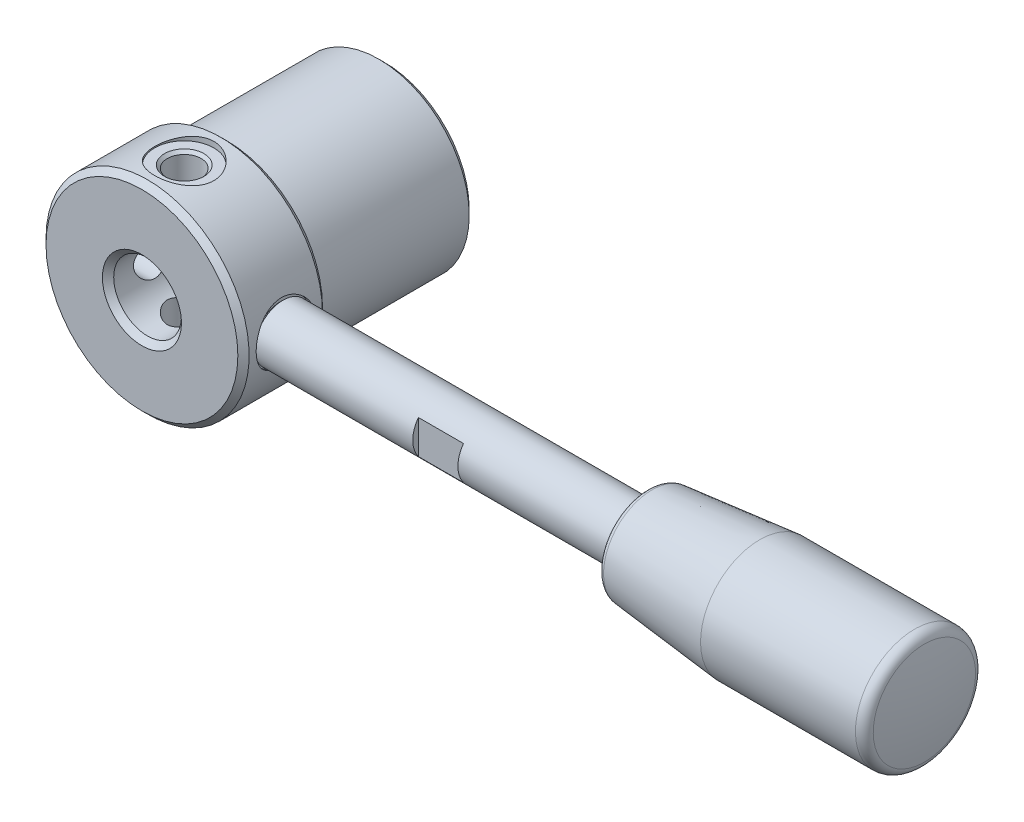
ISO-10303-21;
HEADER;
FILE_DESCRIPTION(('STEP AP214'),'2;1');
FILE_NAME('part.step','',(''),(''),'','','');
FILE_SCHEMA(('AUTOMOTIVE_DESIGN { 1 0 10303 214 1 1 1 1 }'));
ENDSEC;
DATA;
#1=APPLICATION_CONTEXT('core data for automotive mechanical design processes');
#2=APPLICATION_PROTOCOL_DEFINITION('international standard','automotive_design',2000,#1);
#3=PRODUCT_CONTEXT('',#1,'mechanical');
#4=PRODUCT('Part','Part','',(#3));
#5=PRODUCT_RELATED_PRODUCT_CATEGORY('part','',(#4));
#6=PRODUCT_DEFINITION_FORMATION('','',#4);
#7=PRODUCT_DEFINITION_CONTEXT('part definition',#1,'design');
#8=PRODUCT_DEFINITION('design','',#6,#7);
#9=PRODUCT_DEFINITION_SHAPE('','',#8);
#10=(LENGTH_UNIT() NAMED_UNIT(*) SI_UNIT(.MILLI.,.METRE.));
#11=(NAMED_UNIT(*) PLANE_ANGLE_UNIT() SI_UNIT($,.RADIAN.));
#12=(NAMED_UNIT(*) SI_UNIT($,.STERADIAN.) SOLID_ANGLE_UNIT());
#13=UNCERTAINTY_MEASURE_WITH_UNIT(LENGTH_MEASURE(1.E-05),#10,'distance_accuracy_value','');
#14=(GEOMETRIC_REPRESENTATION_CONTEXT(3) GLOBAL_UNCERTAINTY_ASSIGNED_CONTEXT((#13)) GLOBAL_UNIT_ASSIGNED_CONTEXT((#10,
#11,#12)) REPRESENTATION_CONTEXT('',''));
#15=CARTESIAN_POINT('',(0.,0.,0.));
#16=DIRECTION('',(0.,0.,1.));
#17=DIRECTION('',(1.,0.,0.));
#18=AXIS2_PLACEMENT_3D('',#15,#16,#17);
#19=CARTESIAN_POINT('',(17.,0.,7.5));
#20=DIRECTION('',(1.,0.,0.));
#21=DIRECTION('',(0.,1.,0.));
#22=AXIS2_PLACEMENT_3D('',#19,#20,#21);
#23=CONICAL_SURFACE('',#22,4.5,0.785398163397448);
#24=CARTESIAN_POINT('',(17.5,0.,7.5));
#25=DIRECTION('',(-1.,0.,0.));
#26=DIRECTION('',(0.,-1.,0.));
#27=AXIS2_PLACEMENT_3D('',#24,#25,#26);
#28=CIRCLE('',#27,5.);
#29=CARTESIAN_POINT('',(17.5,-4.99999999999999,7.5));
#30=VERTEX_POINT('',#29);
#31=EDGE_CURVE('E67',#30,#30,#28,.F.);
#32=ORIENTED_EDGE('',*,*,#31,.F.);
#33=EDGE_LOOP('',(#32));
#34=FACE_BOUND('',#33,.T.);
#35=CARTESIAN_POINT('',(17.,0.,7.5));
#36=DIRECTION('',(1.,0.,0.));
#37=DIRECTION('',(0.,1.,0.));
#38=AXIS2_PLACEMENT_3D('',#35,#36,#37);
#39=CIRCLE('',#38,4.5);
#40=CARTESIAN_POINT('',(17.,4.50000000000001,7.5));
#41=VERTEX_POINT('',#40);
#42=EDGE_CURVE('E9',#41,#41,#39,.T.);
#43=ORIENTED_EDGE('',*,*,#42,.T.);
#44=EDGE_LOOP('',(#43));
#45=FACE_BOUND('',#44,.T.);
#46=ADVANCED_FACE('F14',(#34,#45),#23,.T.);
#47=CARTESIAN_POINT('',(17.,0.,7.5));
#48=DIRECTION('',(1.,0.,0.));
#49=DIRECTION('',(0.,1.,0.));
#50=AXIS2_PLACEMENT_3D('',#47,#48,#49);
#51=CYLINDRICAL_SURFACE('',#50,5.);
#52=CARTESIAN_POINT('',(81.5,2.08166817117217E-13,7.5));
#53=DIRECTION('',(-1.,0.,0.));
#54=DIRECTION('',(0.,-1.,0.));
#55=AXIS2_PLACEMENT_3D('',#52,#53,#54);
#56=CIRCLE('',#55,5.);
#57=CARTESIAN_POINT('',(81.5,-4.99999999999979,7.5));
#58=VERTEX_POINT('',#57);
#59=EDGE_CURVE('E84',#58,#58,#56,.T.);
#60=ORIENTED_EDGE('',*,*,#59,.T.);
#61=EDGE_LOOP('',(#60));
#62=FACE_BOUND('',#61,.T.);
#63=ORIENTED_EDGE('',*,*,#31,.T.);
#64=EDGE_LOOP('',(#63));
#65=FACE_BOUND('',#64,.T.);
#66=DIRECTION('',(1.,0.,0.));
#67=VECTOR('',#66,1.);
#68=CARTESIAN_POINT('',(17.,-2.99999999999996,3.5));
#69=LINE('',#68,#67);
#70=CARTESIAN_POINT('',(53.5,-3.,3.5));
#71=VERTEX_POINT('',#70);
#72=CARTESIAN_POINT('',(45.5,-3.,3.5));
#73=VERTEX_POINT('',#72);
#74=EDGE_CURVE('E68',#71,#73,#69,.F.);
#75=ORIENTED_EDGE('',*,*,#74,.F.);
#76=CARTESIAN_POINT('',(53.5,0.,7.5000000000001));
#77=DIRECTION('',(1.,0.,0.));
#78=DIRECTION('',(0.,1.,0.));
#79=AXIS2_PLACEMENT_3D('',#76,#77,#78);
#80=CIRCLE('',#79,5.);
#81=CARTESIAN_POINT('',(53.5,3.00000000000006,3.5));
#82=VERTEX_POINT('',#81);
#83=EDGE_CURVE('E30',#71,#82,#80,.T.);
#84=ORIENTED_EDGE('',*,*,#83,.T.);
#85=DIRECTION('',(1.,0.,0.));
#86=VECTOR('',#85,1.);
#87=CARTESIAN_POINT('',(17.,3.0000000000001,3.5));
#88=LINE('',#87,#86);
#89=CARTESIAN_POINT('',(45.5,3.00000000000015,3.5));
#90=VERTEX_POINT('',#89);
#91=EDGE_CURVE('E59',#90,#82,#88,.T.);
#92=ORIENTED_EDGE('',*,*,#91,.F.);
#93=CARTESIAN_POINT('',(45.5,0.,7.5000000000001));
#94=DIRECTION('',(-1.,0.,0.));
#95=DIRECTION('',(0.,-1.,0.));
#96=AXIS2_PLACEMENT_3D('',#93,#94,#95);
#97=CIRCLE('',#96,5.);
#98=EDGE_CURVE('E75',#90,#73,#97,.T.);
#99=ORIENTED_EDGE('',*,*,#98,.T.);
#100=EDGE_LOOP('',(#75,#84,#92,#99));
#101=FACE_BOUND('',#100,.T.);
#102=DIRECTION('',(1.,0.,0.));
#103=VECTOR('',#102,1.);
#104=CARTESIAN_POINT('',(17.,3.00000000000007,11.5));
#105=LINE('',#104,#103);
#106=CARTESIAN_POINT('',(53.5,3.00000000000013,11.5000000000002));
#107=VERTEX_POINT('',#106);
#108=CARTESIAN_POINT('',(45.5,3.00000000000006,11.5));
#109=VERTEX_POINT('',#108);
#110=EDGE_CURVE('E117',#107,#109,#105,.F.);
#111=ORIENTED_EDGE('',*,*,#110,.F.);
#112=CARTESIAN_POINT('',(53.5,0.,7.5000000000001));
#113=DIRECTION('',(1.,0.,0.));
#114=DIRECTION('',(0.,1.,0.));
#115=AXIS2_PLACEMENT_3D('',#112,#113,#114);
#116=CIRCLE('',#115,5.);
#117=CARTESIAN_POINT('',(53.5,-2.9999999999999,11.5000000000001));
#118=VERTEX_POINT('',#117);
#119=EDGE_CURVE('E37',#107,#118,#116,.T.);
#120=ORIENTED_EDGE('',*,*,#119,.T.);
#121=DIRECTION('',(1.,0.,0.));
#122=VECTOR('',#121,1.);
#123=CARTESIAN_POINT('',(17.,-3.,11.5));
#124=LINE('',#123,#122);
#125=CARTESIAN_POINT('',(45.5,-2.99999999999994,11.5000000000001));
#126=VERTEX_POINT('',#125);
#127=EDGE_CURVE('E78',#126,#118,#124,.T.);
#128=ORIENTED_EDGE('',*,*,#127,.F.);
#129=CARTESIAN_POINT('',(45.5,0.,7.5000000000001));
#130=DIRECTION('',(-1.,0.,0.));
#131=DIRECTION('',(0.,-1.,0.));
#132=AXIS2_PLACEMENT_3D('',#129,#130,#131);
#133=CIRCLE('',#132,5.);
#134=EDGE_CURVE('E113',#126,#109,#133,.T.);
#135=ORIENTED_EDGE('',*,*,#134,.T.);
#136=EDGE_LOOP('',(#111,#120,#128,#135));
#137=FACE_BOUND('',#136,.T.);
#138=ADVANCED_FACE('F73',(#62,#65,#101,#137),#51,.T.);
#139=CARTESIAN_POINT('',(81.5,2.08166817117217E-13,7.5));
#140=DIRECTION('',(-1.,0.,0.));
#141=DIRECTION('',(0.,-1.,0.));
#142=AXIS2_PLACEMENT_3D('',#139,#140,#141);
#143=CONICAL_SURFACE('',#142,5.,0.785398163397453);
#144=CARTESIAN_POINT('',(82.,2.08166817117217E-13,7.5));
#145=DIRECTION('',(-1.,0.,0.));
#146=DIRECTION('',(0.,-1.,0.));
#147=AXIS2_PLACEMENT_3D('',#144,#145,#146);
#148=CIRCLE('',#147,4.5);
#149=CARTESIAN_POINT('',(82.,-4.49999999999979,7.5));
#150=VERTEX_POINT('',#149);
#151=EDGE_CURVE('E87',#150,#150,#148,.F.);
#152=ORIENTED_EDGE('',*,*,#151,.F.);
#153=EDGE_LOOP('',(#152));
#154=FACE_BOUND('',#153,.T.);
#155=ORIENTED_EDGE('',*,*,#59,.F.);
#156=EDGE_LOOP('',(#155));
#157=FACE_BOUND('',#156,.T.);
#158=ADVANCED_FACE('F198',(#154,#157),#143,.T.);
#159=CARTESIAN_POINT('',(45.5,-3.99999999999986,3.5));
#160=DIRECTION('',(0.,0.,-1.));
#161=DIRECTION('',(-1.,0.,0.));
#162=AXIS2_PLACEMENT_3D('',#159,#160,#161);
#163=PLANE('',#162);
#164=ORIENTED_EDGE('',*,*,#91,.T.);
#165=DIRECTION('',(0.,-1.,0.));
#166=VECTOR('',#165,1.);
#167=CARTESIAN_POINT('',(53.5,-3.99999999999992,3.49999999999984));
#168=LINE('',#167,#166);
#169=EDGE_CURVE('E61',#82,#71,#168,.T.);
#170=ORIENTED_EDGE('',*,*,#169,.T.);
#171=ORIENTED_EDGE('',*,*,#74,.T.);
#172=DIRECTION('',(0.,1.,0.));
#173=VECTOR('',#172,1.);
#174=CARTESIAN_POINT('',(45.5,-3.99999999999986,3.5));
#175=LINE('',#174,#173);
#176=EDGE_CURVE('E64',#73,#90,#175,.T.);
#177=ORIENTED_EDGE('',*,*,#176,.T.);
#178=EDGE_LOOP('',(#164,#170,#171,#177));
#179=FACE_BOUND('',#178,.T.);
#180=ADVANCED_FACE('F60',(#179),#163,.T.);
#181=CARTESIAN_POINT('',(53.5,-3.99999999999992,3.49999999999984));
#182=DIRECTION('',(1.,0.,0.));
#183=DIRECTION('',(0.,1.,0.));
#184=AXIS2_PLACEMENT_3D('',#181,#182,#183);
#185=PLANE('',#184);
#186=ORIENTED_EDGE('',*,*,#169,.F.);
#187=ORIENTED_EDGE('',*,*,#83,.F.);
#188=EDGE_LOOP('',(#186,#187));
#189=FACE_BOUND('',#188,.T.);
#190=ADVANCED_FACE('F70',(#189),#185,.F.);
#191=CARTESIAN_POINT('',(45.5,-3.99999999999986,3.5));
#192=DIRECTION('',(-1.,0.,0.));
#193=DIRECTION('',(0.,-1.,0.));
#194=AXIS2_PLACEMENT_3D('',#191,#192,#193);
#195=PLANE('',#194);
#196=ORIENTED_EDGE('',*,*,#176,.F.);
#197=ORIENTED_EDGE('',*,*,#98,.F.);
#198=EDGE_LOOP('',(#196,#197));
#199=FACE_BOUND('',#198,.T.);
#200=ADVANCED_FACE('F206',(#199),#195,.F.);
#201=CARTESIAN_POINT('',(45.5,4.0000000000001,11.4999999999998));
#202=DIRECTION('',(0.,0.,1.));
#203=DIRECTION('',(-1.,0.,0.));
#204=AXIS2_PLACEMENT_3D('',#201,#202,#203);
#205=PLANE('',#204);
#206=ORIENTED_EDGE('',*,*,#127,.T.);
#207=DIRECTION('',(0.,1.,0.));
#208=VECTOR('',#207,1.);
#209=CARTESIAN_POINT('',(53.5,4.00000000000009,11.5));
#210=LINE('',#209,#208);
#211=EDGE_CURVE('E111',#118,#107,#210,.T.);
#212=ORIENTED_EDGE('',*,*,#211,.T.);
#213=ORIENTED_EDGE('',*,*,#110,.T.);
#214=DIRECTION('',(0.,-1.,0.));
#215=VECTOR('',#214,1.);
#216=CARTESIAN_POINT('',(45.5,4.0000000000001,11.4999999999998));
#217=LINE('',#216,#215);
#218=EDGE_CURVE('E71',#109,#126,#217,.T.);
#219=ORIENTED_EDGE('',*,*,#218,.T.);
#220=EDGE_LOOP('',(#206,#212,#213,#219));
#221=FACE_BOUND('',#220,.T.);
#222=ADVANCED_FACE('F120',(#221),#205,.T.);
#223=CARTESIAN_POINT('',(53.5,4.00000000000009,11.5));
#224=DIRECTION('',(1.,0.,0.));
#225=DIRECTION('',(0.,1.,0.));
#226=AXIS2_PLACEMENT_3D('',#223,#224,#225);
#227=PLANE('',#226);
#228=ORIENTED_EDGE('',*,*,#211,.F.);
#229=ORIENTED_EDGE('',*,*,#119,.F.);
#230=EDGE_LOOP('',(#228,#229));
#231=FACE_BOUND('',#230,.T.);
#232=ADVANCED_FACE('F123',(#231),#227,.F.);
#233=CARTESIAN_POINT('',(45.5,4.0000000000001,11.4999999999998));
#234=DIRECTION('',(-1.,0.,0.));
#235=DIRECTION('',(0.,-1.,0.));
#236=AXIS2_PLACEMENT_3D('',#233,#234,#235);
#237=PLANE('',#236);
#238=ORIENTED_EDGE('',*,*,#218,.F.);
#239=ORIENTED_EDGE('',*,*,#134,.F.);
#240=EDGE_LOOP('',(#238,#239));
#241=FACE_BOUND('',#240,.T.);
#242=ADVANCED_FACE('F125',(#241),#237,.F.);
#243=CARTESIAN_POINT('',(82.,1.80411241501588E-13,7.5000000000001));
#244=DIRECTION('',(-1.,0.,0.));
#245=DIRECTION('',(0.,0.565644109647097,0.824649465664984));
#246=AXIS2_PLACEMENT_3D('',#243,#244,#245);
#247=PLANE('',#246);
#248=ORIENTED_EDGE('',*,*,#151,.T.);
#249=EDGE_LOOP('',(#248));
#250=FACE_BOUND('',#249,.T.);
#251=CARTESIAN_POINT('',(82.,1.80411241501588E-13,7.5000000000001));
#252=DIRECTION('',(-1.,0.,0.));
#253=DIRECTION('',(0.,0.565644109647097,0.824649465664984));
#254=AXIS2_PLACEMENT_3D('',#251,#252,#253);
#255=CIRCLE('',#254,7.59501243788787);
#256=CARTESIAN_POINT('',(82.,4.29607404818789,13.7632229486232));
#257=VERTEX_POINT('',#256);
#258=EDGE_CURVE('E18',#257,#257,#255,.T.);
#259=ORIENTED_EDGE('',*,*,#258,.T.);
#260=EDGE_LOOP('',(#259));
#261=FACE_BOUND('',#260,.T.);
#262=ADVANCED_FACE('F127',(#250,#261),#247,.T.);
#263=CARTESIAN_POINT('',(83.,1.66533453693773E-13,7.50000000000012));
#264=DIRECTION('',(-1.,0.,0.));
#265=DIRECTION('',(0.,0.565644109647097,0.824649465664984));
#266=AXIS2_PLACEMENT_3D('',#263,#264,#265);
#267=TOROIDAL_SURFACE('',#266,7.59501243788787,1.);
#268=CARTESIAN_POINT('',(82.9004962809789,1.66533453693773E-13,7.50000000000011));
#269=DIRECTION('',(-1.,0.,0.));
#270=DIRECTION('',(0.,0.565644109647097,0.824649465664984));
#271=AXIS2_PLACEMENT_3D('',#268,#269,#270);
#272=CIRCLE('',#271,8.59004962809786);
#273=CARTESIAN_POINT('',(82.9004962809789,4.85891097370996,14.5837798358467));
#274=VERTEX_POINT('',#273);
#275=EDGE_CURVE('E99',#274,#274,#272,.T.);
#276=ORIENTED_EDGE('',*,*,#275,.T.);
#277=EDGE_LOOP('',(#276));
#278=FACE_BOUND('',#277,.T.);
#279=ORIENTED_EDGE('',*,*,#258,.F.);
#280=EDGE_LOOP('',(#279));
#281=FACE_BOUND('',#280,.T.);
#282=ADVANCED_FACE('F136',(#278,#281),#267,.T.);
#283=CARTESIAN_POINT('',(82.9004962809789,1.66533453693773E-13,7.50000000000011));
#284=DIRECTION('',(1.,0.,0.));
#285=DIRECTION('',(0.,-0.565644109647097,-0.824649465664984));
#286=AXIS2_PLACEMENT_3D('',#283,#284,#285);
#287=CONICAL_SURFACE('',#286,8.59004962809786,0.0996686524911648);
#288=CARTESIAN_POINT('',(102.,2.35922392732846E-13,7.50000000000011));
#289=DIRECTION('',(-1.,0.,0.));
#290=DIRECTION('',(0.,0.565644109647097,0.824649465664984));
#291=AXIS2_PLACEMENT_3D('',#288,#289,#290);
#292=CIRCLE('',#291,10.5);
#293=CARTESIAN_POINT('',(102.,5.93926315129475,16.1588193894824));
#294=VERTEX_POINT('',#293);
#295=EDGE_CURVE('E97',#294,#294,#292,.T.);
#296=ORIENTED_EDGE('',*,*,#295,.T.);
#297=EDGE_LOOP('',(#296));
#298=FACE_BOUND('',#297,.T.);
#299=ORIENTED_EDGE('',*,*,#275,.F.);
#300=EDGE_LOOP('',(#299));
#301=FACE_BOUND('',#300,.T.);
#302=ADVANCED_FACE('F522',(#298,#301),#287,.T.);
#303=CARTESIAN_POINT('',(82.,1.80411241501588E-13,7.5000000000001));
#304=DIRECTION('',(-1.,0.,0.));
#305=DIRECTION('',(0.,0.565644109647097,0.824649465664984));
#306=AXIS2_PLACEMENT_3D('',#303,#304,#305);
#307=CYLINDRICAL_SURFACE('',#306,10.5);
#308=CARTESIAN_POINT('',(129.449973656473,1.94289029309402E-13,7.5000000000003));
#309=DIRECTION('',(-1.,0.,0.));
#310=DIRECTION('',(0.,0.565644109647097,0.824649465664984));
#311=AXIS2_PLACEMENT_3D('',#308,#309,#310);
#312=CIRCLE('',#311,10.5);
#313=CARTESIAN_POINT('',(129.449973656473,5.93926315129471,16.1588193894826));
#314=VERTEX_POINT('',#313);
#315=EDGE_CURVE('E94',#314,#314,#312,.T.);
#316=ORIENTED_EDGE('',*,*,#315,.T.);
#317=EDGE_LOOP('',(#316));
#318=FACE_BOUND('',#317,.T.);
#319=ORIENTED_EDGE('',*,*,#295,.F.);
#320=EDGE_LOOP('',(#319));
#321=FACE_BOUND('',#320,.T.);
#322=ADVANCED_FACE('F141',(#318,#321),#307,.T.);
#323=CARTESIAN_POINT('',(129.449973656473,1.94289029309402E-13,7.5000000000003));
#324=DIRECTION('',(-1.,0.,0.));
#325=DIRECTION('',(0.,0.565644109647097,0.824649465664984));
#326=AXIS2_PLACEMENT_3D('',#323,#324,#325);
#327=TOROIDAL_SURFACE('',#326,8.75,1.75000000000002);
#328=CARTESIAN_POINT('',(131.170957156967,2.22044604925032E-13,7.50000000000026));
#329=DIRECTION('',(-1.,0.,0.));
#330=DIRECTION('',(0.,0.565644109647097,0.824649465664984));
#331=AXIS2_PLACEMENT_3D('',#328,#329,#330);
#332=CIRCLE('',#331,9.06735751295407);
#333=CARTESIAN_POINT('',(131.170957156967,5.12889736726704,14.9773915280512));
#334=VERTEX_POINT('',#333);
#335=EDGE_CURVE('E91',#334,#334,#332,.T.);
#336=ORIENTED_EDGE('',*,*,#335,.T.);
#337=EDGE_LOOP('',(#336));
#338=FACE_BOUND('',#337,.T.);
#339=ORIENTED_EDGE('',*,*,#315,.F.);
#340=EDGE_LOOP('',(#339));
#341=FACE_BOUND('',#340,.T.);
#342=ADVANCED_FACE('F129',(#338,#341),#327,.T.);
#343=CARTESIAN_POINT('',(82.,1.80411241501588E-13,7.5000000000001));
#344=DIRECTION('',(-1.,0.,0.));
#345=DIRECTION('',(0.,0.824649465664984,-0.565644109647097));
#346=AXIS2_PLACEMENT_3D('',#343,#344,#345);
#347=SPHERICAL_SURFACE('',#346,50.);
#348=ORIENTED_EDGE('',*,*,#335,.F.);
#349=EDGE_LOOP('',(#348));
#350=FACE_BOUND('',#349,.T.);
#351=ADVANCED_FACE('F16',(#350),#347,.T.);
#352=CARTESIAN_POINT('',(12.0000000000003,0.,7.5));
#353=DIRECTION('',(1.,0.,0.));
#354=DIRECTION('',(0.,-0.704039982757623,-0.710160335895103));
#355=AXIS2_PLACEMENT_3D('',#352,#353,#354);
#356=CONICAL_SURFACE('',#355,3.,0.785398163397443);
#357=CARTESIAN_POINT('',(11.0000000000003,0.,7.5));
#358=DIRECTION('',(1.,0.,0.));
#359=DIRECTION('',(0.,-0.704039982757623,-0.710160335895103));
#360=AXIS2_PLACEMENT_3D('',#357,#358,#359);
#361=CIRCLE('',#360,2.);
#362=CARTESIAN_POINT('',(11.0000000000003,-1.40807996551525,6.07967932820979));
#363=VERTEX_POINT('',#362);
#364=EDGE_CURVE('E90',#363,#363,#361,.T.);
#365=ORIENTED_EDGE('',*,*,#364,.T.);
#366=EDGE_LOOP('',(#365));
#367=FACE_BOUND('',#366,.T.);
#368=CARTESIAN_POINT('',(12.0000000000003,0.,7.5));
#369=DIRECTION('',(1.,0.,0.));
#370=DIRECTION('',(0.,1.,0.));
#371=AXIS2_PLACEMENT_3D('',#368,#369,#370);
#372=CIRCLE('',#371,3.);
#373=CARTESIAN_POINT('',(12.0000000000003,3.00000000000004,7.5));
#374=VERTEX_POINT('',#373);
#375=EDGE_CURVE('E23',#374,#374,#372,.T.);
#376=ORIENTED_EDGE('',*,*,#375,.F.);
#377=EDGE_LOOP('',(#376));
#378=FACE_BOUND('',#377,.T.);
#379=ADVANCED_FACE('F186',(#367,#378),#356,.T.);
#380=CARTESIAN_POINT('',(11.0000000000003,0.,7.5));
#381=DIRECTION('',(1.,0.,0.));
#382=DIRECTION('',(0.,-0.704039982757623,-0.710160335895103));
#383=AXIS2_PLACEMENT_3D('',#380,#381,#382);
#384=PLANE('',#383);
#385=ORIENTED_EDGE('',*,*,#364,.F.);
#386=EDGE_LOOP('',(#385));
#387=FACE_BOUND('',#386,.T.);
#388=ADVANCED_FACE('F189',(#387),#384,.F.);
#389=CARTESIAN_POINT('',(-18.,0.,7.5));
#390=DIRECTION('',(1.,0.,0.));
#391=DIRECTION('',(0.,1.,0.));
#392=AXIS2_PLACEMENT_3D('',#389,#390,#391);
#393=CYLINDRICAL_SURFACE('',#392,3.);
#394=ORIENTED_EDGE('',*,*,#375,.T.);
#395=EDGE_LOOP('',(#394));
#396=FACE_BOUND('',#395,.T.);
#397=CARTESIAN_POINT('',(5.19615242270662,3.,7.5));
#398=CARTESIAN_POINT('',(5.19615338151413,2.99999910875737,7.5782002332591));
#399=CARTESIAN_POINT('',(5.19792581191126,2.99693611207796,7.65640999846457));
#400=CARTESIAN_POINT('',(5.20493931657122,2.98473565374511,7.81220807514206));
#401=CARTESIAN_POINT('',(5.21018200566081,2.9755953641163,7.8897960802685));
#402=CARTESIAN_POINT('',(5.23088200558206,2.93916912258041,8.12094401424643));
#403=CARTESIAN_POINT('',(5.25131076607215,2.90287805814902,8.27275091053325));
#404=CARTESIAN_POINT('',(5.30247746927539,2.80829998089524,8.56639163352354));
#405=CARTESIAN_POINT('',(5.33316051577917,2.75012989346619,8.70827380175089));
#406=CARTESIAN_POINT('',(5.40128072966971,2.61380253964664,8.98026276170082));
#407=CARTESIAN_POINT('',(5.43871826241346,2.53564419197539,9.11036891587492));
#408=CARTESIAN_POINT('',(5.51990583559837,2.35399963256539,9.36692014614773));
#409=CARTESIAN_POINT('',(5.5639218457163,2.24895611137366,9.49217820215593));
#410=CARTESIAN_POINT('',(5.65115954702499,2.01976141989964,9.72422436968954));
#411=CARTESIAN_POINT('',(5.6943808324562,1.89560077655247,9.83100326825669));
#412=CARTESIAN_POINT('',(5.77864428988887,1.62146869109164,10.0301016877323));
#413=CARTESIAN_POINT('',(5.81934318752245,1.47032156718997,10.1209613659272));
#414=CARTESIAN_POINT('',(5.89052268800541,1.15247107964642,10.2754224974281));
#415=CARTESIAN_POINT('',(5.92100973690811,0.985777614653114,10.3390411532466));
#416=CARTESIAN_POINT('',(5.96641383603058,0.654134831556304,10.4325139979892));
#417=CARTESIAN_POINT('',(5.98228440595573,0.489905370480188,10.464448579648));
#418=CARTESIAN_POINT('',(6.00022751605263,0.157711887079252,10.500498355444));
#419=CARTESIAN_POINT('',(6.00230840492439,-0.0102498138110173,10.5046303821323));
#420=CARTESIAN_POINT('',(5.9928894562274,-0.329497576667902,10.4857599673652));
#421=CARTESIAN_POINT('',(5.98255487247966,-0.480963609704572,10.465085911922));
#422=CARTESIAN_POINT('',(5.9512273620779,-0.777941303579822,10.4013575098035));
#423=CARTESIAN_POINT('',(5.93023363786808,-0.923452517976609,10.3583014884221));
#424=CARTESIAN_POINT('',(5.87914748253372,-1.2069282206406,10.2507521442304));
#425=CARTESIAN_POINT('',(5.8489331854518,-1.34476044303,10.1859704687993));
#426=CARTESIAN_POINT('',(5.78212944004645,-1.60793023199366,10.0372103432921));
#427=CARTESIAN_POINT('',(5.74553771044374,-1.7332633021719,9.95322502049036));
#428=CARTESIAN_POINT('',(5.66533158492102,-1.98052168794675,9.75931152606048));
#429=CARTESIAN_POINT('',(5.62138031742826,-2.10100497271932,9.64768148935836));
#430=CARTESIAN_POINT('',(5.53363118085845,-2.32231036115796,9.40624025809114));
#431=CARTESIAN_POINT('',(5.48983345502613,-2.42311733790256,9.27641520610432));
#432=CARTESIAN_POINT('',(5.40432084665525,-2.60852695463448,8.99201785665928));
#433=CARTESIAN_POINT('',(5.36291485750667,-2.69169402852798,8.83639756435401));
#434=CARTESIAN_POINT('',(5.30915194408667,-2.79542837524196,8.59243694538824));
#435=CARTESIAN_POINT('',(5.29261946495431,-2.82650797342,8.50934368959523));
#436=CARTESIAN_POINT('',(5.2629847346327,-2.88131297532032,8.34019139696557));
#437=CARTESIAN_POINT('',(5.24988036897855,-2.90504291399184,8.25413422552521));
#438=CARTESIAN_POINT('',(5.22855455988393,-2.94323927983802,8.08662837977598));
#439=CARTESIAN_POINT('',(5.22002982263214,-2.95828810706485,8.00535057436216));
#440=CARTESIAN_POINT('',(5.20672737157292,-2.9816390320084,7.84156476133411));
#441=CARTESIAN_POINT('',(5.2019477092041,-2.98994463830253,7.75905741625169));
#442=CARTESIAN_POINT('',(5.19633662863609,-2.99968663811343,7.5935289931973));
#443=CARTESIAN_POINT('',(5.19550374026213,-3.00112558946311,7.51050811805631));
#444=CARTESIAN_POINT('',(5.19780953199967,-2.99712742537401,7.34471353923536));
#445=CARTESIAN_POINT('',(5.20094794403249,-2.99169077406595,7.26193981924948));
#446=CARTESIAN_POINT('',(5.21504493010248,-2.96710135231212,7.03314086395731));
#447=CARTESIAN_POINT('',(5.23019160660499,-2.94056163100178,6.88808918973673));
#448=CARTESIAN_POINT('',(5.27081666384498,-2.86709067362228,6.60486908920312));
#449=CARTESIAN_POINT('',(5.29629839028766,-2.82015283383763,6.46670290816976));
#450=CARTESIAN_POINT('',(5.35608780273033,-2.70494224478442,6.19377389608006));
#451=CARTESIAN_POINT('',(5.39074960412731,-2.63578205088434,6.05946507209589));
#452=CARTESIAN_POINT('',(5.46468327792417,-2.47886133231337,5.80359006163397));
#453=CARTESIAN_POINT('',(5.50395751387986,-2.39109125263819,5.68203046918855));
#454=CARTESIAN_POINT('',(5.58864005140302,-2.18651145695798,5.43906437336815));
#455=CARTESIAN_POINT('',(5.63419752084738,-2.06743580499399,5.31960872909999));
#456=CARTESIAN_POINT('',(5.72202702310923,-1.81021349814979,5.10176310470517));
#457=CARTESIAN_POINT('',(5.76429794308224,-1.67206042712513,5.00338024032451));
#458=CARTESIAN_POINT('',(5.84224085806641,-1.37560608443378,4.82827887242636));
#459=CARTESIAN_POINT('',(5.87770925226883,-1.21686929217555,4.75220065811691));
#460=CARTESIAN_POINT('',(5.93650064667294,-0.886567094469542,4.62858627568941));
#461=CARTESIAN_POINT('',(5.95983430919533,-0.715013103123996,4.58102504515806));
#462=CARTESIAN_POINT('',(5.9900252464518,-0.380939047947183,4.51989430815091));
#463=CARTESIAN_POINT('',(5.99819783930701,-0.219034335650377,4.50360636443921));
#464=CARTESIAN_POINT('',(6.00126390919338,0.105377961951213,4.49747021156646));
#465=CARTESIAN_POINT('',(5.99616203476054,0.267885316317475,4.50761274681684));
#466=CARTESIAN_POINT('',(5.97401907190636,0.577613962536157,4.55224919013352));
#467=CARTESIAN_POINT('',(5.95778686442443,0.725136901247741,4.58509443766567));
#468=CARTESIAN_POINT('',(5.91576278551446,1.01233790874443,4.67198110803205));
#469=CARTESIAN_POINT('',(5.88996954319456,1.1520148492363,4.72602557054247));
#470=CARTESIAN_POINT('',(5.82977801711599,1.42627001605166,4.85618072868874));
#471=CARTESIAN_POINT('',(5.79505887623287,1.56037465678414,4.93313634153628));
#472=CARTESIAN_POINT('',(5.72064363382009,1.81432469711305,5.10587542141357));
#473=CARTESIAN_POINT('',(5.6809452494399,1.93416350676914,5.20166753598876));
#474=CARTESIAN_POINT('',(5.59585978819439,2.16873884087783,5.42038472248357));
#475=CARTESIAN_POINT('',(5.55029975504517,2.28178066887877,5.54506132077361));
#476=CARTESIAN_POINT('',(5.46188649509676,2.4860022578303,5.81237832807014));
#477=CARTESIAN_POINT('',(5.41903568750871,2.57716267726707,5.95503446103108));
#478=CARTESIAN_POINT('',(5.36004774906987,2.69665559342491,6.18253179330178));
#479=CARTESIAN_POINT('',(5.34101219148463,2.73405408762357,6.26197580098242));
#480=CARTESIAN_POINT('',(5.30572783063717,2.80191257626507,6.42435328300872));
#481=CARTESIAN_POINT('',(5.28947759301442,2.83237614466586,6.50728493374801));
#482=CARTESIAN_POINT('',(5.26045215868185,2.8859262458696,6.67584473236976));
#483=CARTESIAN_POINT('',(5.2476680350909,2.90903175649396,6.76146530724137));
#484=CARTESIAN_POINT('',(5.22608869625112,2.94762428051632,6.93485525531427));
#485=CARTESIAN_POINT('',(5.21729069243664,2.96311662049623,7.02262308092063));
#486=CARTESIAN_POINT('',(5.20588528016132,2.98309381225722,7.17539881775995));
#487=CARTESIAN_POINT('',(5.20224442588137,2.98942746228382,7.24009480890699));
#488=CARTESIAN_POINT('',(5.19737751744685,2.99788106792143,7.36985831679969));
#489=CARTESIAN_POINT('',(5.19615162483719,3.00000074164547,7.43492585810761));
#490=CARTESIAN_POINT('',(5.19615242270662,3.,7.5));
#491=B_SPLINE_CURVE_WITH_KNOTS('',3,(#397,#398,#399,#400,#401,#402,#403,#404,#405,#406,#407,
#408,#409,#410,#411,#412,#413,#414,#415,#416,#417,#418,#419,#420,#421,#422,#423,#424,#425,#426,
#427,#428,#429,#430,#431,#432,#433,#434,#435,#436,#437,#438,#439,#440,#441,#442,#443,#444,#445,
#446,#447,#448,#449,#450,#451,#452,#453,#454,#455,#456,#457,#458,#459,#460,#461,#462,#463,#464,
#465,#466,#467,#468,#469,#470,#471,#472,#473,#474,#475,#476,#477,#478,#479,#480,#481,#482,#483,
#484,#485,#486,#487,#488,#489,#490),.UNSPECIFIED.,.T.,.F.,(4,2,2,2,2,2,2,2,2,2,2,2,2,2,2,2,2,2,
2,2,2,2,2,2,2,2,2,2,2,2,2,2,2,2,2,2,2,2,2,2,2,2,2,2,2,2,4),(0.,0.234529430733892,
0.469168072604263,0.938850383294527,1.40605749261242,1.87328988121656,2.37905864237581,
2.88507883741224,3.42520847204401,3.96499651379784,4.46637625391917,4.96745241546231,
5.42495462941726,5.88249108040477,6.34635774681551,6.81039068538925,7.31828744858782,
7.82657315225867,8.36713695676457,8.63752916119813,8.90775419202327,9.15669600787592,
9.40550821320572,9.65422772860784,9.90293045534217,10.3454331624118,10.7880792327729,
11.2512265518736,11.7146122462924,12.2364099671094,12.758383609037,13.29413310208,
13.8294110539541,14.3155757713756,14.8015702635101,15.2555404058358,15.7095756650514,
16.1830301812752,16.6567025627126,17.177514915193,17.6987859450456,17.9680115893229,
18.2370981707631,18.5054849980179,18.7736837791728,18.9688338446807,19.1639969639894),.UNSPECIFIED.);
#492=CARTESIAN_POINT('',(5.19615242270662,3.,7.5));
#493=VERTEX_POINT('',#492);
#494=EDGE_CURVE('E561',#493,#493,#491,.T.);
#495=ORIENTED_EDGE('',*,*,#494,.F.);
#496=EDGE_LOOP('',(#495));
#497=FACE_BOUND('',#496,.T.);
#498=ADVANCED_FACE('F193',(#396,#497),#393,.F.);
#499=CARTESIAN_POINT('',(0.,0.,-28.));
#500=DIRECTION('',(0.,0.,-1.));
#501=DIRECTION('',(-1.,0.,0.));
#502=AXIS2_PLACEMENT_3D('',#499,#500,#501);
#503=CYLINDRICAL_SURFACE('',#502,6.);
#504=CARTESIAN_POINT('',(-6.,0.,10.5));
#505=CARTESIAN_POINT('',(-5.99999934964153,0.07889414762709,10.4999991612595));
#506=CARTESIAN_POINT('',(-5.99843869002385,0.15779662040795,10.4968820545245));
#507=CARTESIAN_POINT('',(-5.99224358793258,0.315001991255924,10.48446072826));
#508=CARTESIAN_POINT('',(-5.98760776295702,0.393304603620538,10.4751537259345));
#509=CARTESIAN_POINT('',(-5.96921978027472,0.626628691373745,10.4380421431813));
#510=CARTESIAN_POINT('',(-5.95098734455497,0.779952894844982,10.4010471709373));
#511=CARTESIAN_POINT('',(-5.90448966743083,1.07683586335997,10.3044182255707));
#512=CARTESIAN_POINT('',(-5.87626344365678,1.22043005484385,10.2448722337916));
#513=CARTESIAN_POINT('',(-5.81237302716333,1.49540820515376,10.1052887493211));
#514=CARTESIAN_POINT('',(-5.77670942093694,1.62679312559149,10.0252528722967));
#515=CARTESIAN_POINT('',(-5.69868752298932,1.88252701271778,9.84144601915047));
#516=CARTESIAN_POINT('',(-5.65605474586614,2.0059694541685,9.73653205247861));
#517=CARTESIAN_POINT('',(-5.56980033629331,2.23433451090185,9.50844407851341));
#518=CARTESIAN_POINT('',(-5.5261779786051,2.3392430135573,9.38525628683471));
#519=CARTESIAN_POINT('',(-5.43896347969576,2.53576864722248,9.11251563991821));
#520=CARTESIAN_POINT('',(-5.39563602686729,2.62572411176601,8.96165902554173));
#521=CARTESIAN_POINT('',(-5.33782449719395,2.7403403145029,8.72404914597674));
#522=CARTESIAN_POINT('',(-5.31974570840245,2.77516786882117,8.64292907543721));
#523=CARTESIAN_POINT('',(-5.28665768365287,2.83769299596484,8.4773994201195));
#524=CARTESIAN_POINT('',(-5.27164663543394,2.86539478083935,8.39299181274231));
#525=CARTESIAN_POINT('',(-5.24610341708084,2.91188280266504,8.22660420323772));
#526=CARTESIAN_POINT('',(-5.23535838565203,2.93110042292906,8.14477720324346));
#527=CARTESIAN_POINT('',(-5.21757784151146,2.96263559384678,7.97944509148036));
#528=CARTESIAN_POINT('',(-5.21054036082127,2.97495680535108,7.89594089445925));
#529=CARTESIAN_POINT('',(-5.20047756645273,2.99251382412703,7.72799363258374));
#530=CARTESIAN_POINT('',(-5.19744983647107,2.99775389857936,7.64355116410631));
#531=CARTESIAN_POINT('',(-5.19552555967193,3.00108452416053,7.47450634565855));
#532=CARTESIAN_POINT('',(-5.19662861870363,2.99917575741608,7.38990401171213));
#533=CARTESIAN_POINT('',(-5.20534668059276,2.98404973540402,7.15724610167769));
#534=CARTESIAN_POINT('',(-5.2172679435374,2.96335042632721,7.00975584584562));
#535=CARTESIAN_POINT('',(-5.25228182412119,2.90082280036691,6.72080632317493));
#536=CARTESIAN_POINT('',(-5.27537800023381,2.85898775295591,6.57934899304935));
#537=CARTESIAN_POINT('',(-5.33062568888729,2.75462843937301,6.30232034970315));
#538=CARTESIAN_POINT('',(-5.36297559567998,2.69164495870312,6.16696288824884));
#539=CARTESIAN_POINT('',(-5.43310175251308,2.54712530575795,5.90809503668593));
#540=CARTESIAN_POINT('',(-5.47088043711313,2.4655808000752,5.78459000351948));
#541=CARTESIAN_POINT('',(-5.55339485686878,2.27419808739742,5.53643690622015));
#542=CARTESIAN_POINT('',(-5.59840533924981,2.16208335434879,5.41362955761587));
#543=CARTESIAN_POINT('',(-5.68642866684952,1.91866675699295,5.18779356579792));
#544=CARTESIAN_POINT('',(-5.72944054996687,1.78735577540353,5.08477437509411));
#545=CARTESIAN_POINT('',(-5.81105962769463,1.50154951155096,4.89694306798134));
#546=CARTESIAN_POINT('',(-5.84936952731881,1.34626077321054,4.81319859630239));
#547=CARTESIAN_POINT('',(-5.91473643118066,1.02139864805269,4.67370889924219));
#548=CARTESIAN_POINT('',(-5.94180236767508,0.851836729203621,4.61794144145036));
#549=CARTESIAN_POINT('',(-5.97973001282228,0.518299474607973,4.5405737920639));
#550=CARTESIAN_POINT('',(-5.99174814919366,0.355024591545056,4.51652629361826));
#551=CARTESIAN_POINT('',(-6.00219040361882,0.0263387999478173,4.49560580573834));
#552=CARTESIAN_POINT('',(-6.00062096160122,-0.139071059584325,4.49871994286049));
#553=CARTESIAN_POINT('',(-5.98473576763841,-0.453698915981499,4.53062006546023));
#554=CARTESIAN_POINT('',(-5.97141737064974,-0.603178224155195,4.55739759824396));
#555=CARTESIAN_POINT('',(-5.93466513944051,-0.895220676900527,4.6327142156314));
#556=CARTESIAN_POINT('',(-5.91123019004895,-1.0377830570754,4.68125569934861));
#557=CARTESIAN_POINT('',(-5.85552754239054,-1.31666582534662,4.7999953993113));
#558=CARTESIAN_POINT('',(-5.82302645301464,-1.45269119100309,4.87077315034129));
#559=CARTESIAN_POINT('',(-5.75231922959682,-1.71138408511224,5.03132260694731));
#560=CARTESIAN_POINT('',(-5.71411066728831,-1.83404588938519,5.12110240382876));
#561=CARTESIAN_POINT('',(-5.63124663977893,-2.07530306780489,5.32728127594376));
#562=CARTESIAN_POINT('',(-5.58632654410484,-2.19231623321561,5.44542860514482));
#563=CARTESIAN_POINT('',(-5.49787174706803,-2.40556896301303,5.69977545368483));
#564=CARTESIAN_POINT('',(-5.45433802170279,-2.50179415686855,5.83598735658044));
#565=CARTESIAN_POINT('',(-5.37153576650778,-2.67512374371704,6.13093096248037));
#566=CARTESIAN_POINT('',(-5.33257588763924,-2.75107648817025,6.2904337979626));
#567=CARTESIAN_POINT('',(-5.26722216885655,-2.87424847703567,6.6225302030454));
#568=CARTESIAN_POINT('',(-5.2408121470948,-2.92150474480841,6.79510658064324));
#569=CARTESIAN_POINT('',(-5.20684503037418,-2.98158506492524,7.1307306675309));
#570=CARTESIAN_POINT('',(-5.19772150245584,-2.99727899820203,7.29310275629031));
#571=CARTESIAN_POINT('',(-5.19496064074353,-3.00206745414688,7.61834120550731));
#572=CARTESIAN_POINT('',(-5.20131659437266,-2.99117350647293,7.78120732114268));
#573=CARTESIAN_POINT('',(-5.22713585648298,-2.94577840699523,8.08645049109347));
#574=CARTESIAN_POINT('',(-5.24529281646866,-2.91362505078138,8.22930136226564));
#575=CARTESIAN_POINT('',(-5.29113050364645,-2.8295259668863,8.50742440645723));
#576=CARTESIAN_POINT('',(-5.31881429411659,-2.77757387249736,8.642694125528));
#577=CARTESIAN_POINT('',(-5.38285583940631,-2.65144766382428,8.91187436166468));
#578=CARTESIAN_POINT('',(-5.41967139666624,-2.57601505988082,9.04508296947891));
#579=CARTESIAN_POINT('',(-5.49706022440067,-2.40645126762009,9.29782434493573));
#580=CARTESIAN_POINT('',(-5.5376354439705,-2.31231035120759,9.41734994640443));
#581=CARTESIAN_POINT('',(-5.62386853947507,-2.094616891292,9.65442285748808));
#582=CARTESIAN_POINT('',(-5.66954494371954,-1.96888052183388,9.76996512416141));
#583=CARTESIAN_POINT('',(-5.75633712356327,-1.69843715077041,9.97880114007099));
#584=CARTESIAN_POINT('',(-5.79745043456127,-1.55371998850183,10.0720828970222));
#585=CARTESIAN_POINT('',(-5.85251406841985,-1.32452333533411,10.1931781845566));
#586=CARTESIAN_POINT('',(-5.86982524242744,-1.24575314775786,10.2305202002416));
#587=CARTESIAN_POINT('',(-5.90168845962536,-1.08479725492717,10.2983616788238));
#588=CARTESIAN_POINT('',(-5.91624185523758,-1.00261324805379,10.3288644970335));
#589=CARTESIAN_POINT('',(-5.94212690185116,-0.835616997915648,10.3826072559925));
#590=CARTESIAN_POINT('',(-5.95346557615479,-0.750810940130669,10.405863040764));
#591=CARTESIAN_POINT('',(-5.9726077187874,-0.57914235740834,10.4448825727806));
#592=CARTESIAN_POINT('',(-5.9804133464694,-0.492281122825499,10.4606508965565));
#593=CARTESIAN_POINT('',(-5.99085829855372,-0.337824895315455,10.4816846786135));
#594=CARTESIAN_POINT('',(-5.99428035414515,-0.27049516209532,10.488546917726));
#595=CARTESIAN_POINT('',(-5.99885151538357,-0.135445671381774,10.497705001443));
#596=CARTESIAN_POINT('',(-6.00000055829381,-0.0677259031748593,10.5000007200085));
#597=CARTESIAN_POINT('',(-6.,0.,10.5));
#598=B_SPLINE_CURVE_WITH_KNOTS('',3,(#504,#505,#506,#507,#508,#509,#510,#511,#512,#513,#514,
#515,#516,#517,#518,#519,#520,#521,#522,#523,#524,#525,#526,#527,#528,#529,#530,#531,#532,#533,
#534,#535,#536,#537,#538,#539,#540,#541,#542,#543,#544,#545,#546,#547,#548,#549,#550,#551,#552,
#553,#554,#555,#556,#557,#558,#559,#560,#561,#562,#563,#564,#565,#566,#567,#568,#569,#570,#571,
#572,#573,#574,#575,#576,#577,#578,#579,#580,#581,#582,#583,#584,#585,#586,#587,#588,#589,#590,
#591,#592,#593,#594,#595,#596,#597),.UNSPECIFIED.,.T.,.F.,(4,2,2,2,2,2,2,2,2,2,2,2,2,2,2,2,2,2,
2,2,2,2,2,2,2,2,2,2,2,2,2,2,2,2,2,2,2,2,2,2,2,2,2,2,2,2,4),(0.,0.236611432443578,
0.473329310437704,0.947100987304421,1.41904300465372,1.89094781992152,2.3914018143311,
2.89223525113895,3.43190833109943,3.7019271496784,3.97178599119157,4.22563720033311,
4.47935352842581,4.73291689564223,4.98645606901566,5.43238672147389,5.87845946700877,
6.33492255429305,6.7915909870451,7.3061635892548,7.82098138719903,8.35970601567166,
8.89800185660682,9.3917140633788,9.88519228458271,10.3404225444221,10.7957029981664,
11.2640010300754,11.7324988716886,12.2470036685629,12.7618630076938,13.3016558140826,
13.8407507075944,14.3280945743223,14.8152271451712,15.2559532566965,15.6968212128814,
16.1673090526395,16.6380421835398,17.1659726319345,17.694186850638,17.9605054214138,
18.2266930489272,18.4922945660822,18.7577335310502,18.9608446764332,19.1639614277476),.UNSPECIFIED.);
#599=CARTESIAN_POINT('',(-6.,0.,10.5));
#600=VERTEX_POINT('',#599);
#601=EDGE_CURVE('E566',#600,#600,#598,.T.);
#602=ORIENTED_EDGE('',*,*,#601,.T.);
#603=EDGE_LOOP('',(#602));
#604=FACE_BOUND('',#603,.T.);
#605=ORIENTED_EDGE('',*,*,#494,.T.);
#606=EDGE_LOOP('',(#605));
#607=FACE_BOUND('',#606,.T.);
#608=CARTESIAN_POINT('',(-2.99999999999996,-5.19615242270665,7.5));
#609=CARTESIAN_POINT('',(-2.99999910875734,-5.19615338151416,7.4217997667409));
#610=CARTESIAN_POINT('',(-2.99693611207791,-5.19792581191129,7.34359000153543));
#611=CARTESIAN_POINT('',(-2.98473565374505,-5.20493931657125,7.18779192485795));
#612=CARTESIAN_POINT('',(-2.97559536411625,-5.21018200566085,7.11020391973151));
#613=CARTESIAN_POINT('',(-2.93916912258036,-5.23088200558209,6.87905598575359));
#614=CARTESIAN_POINT('',(-2.90287805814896,-5.25131076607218,6.72724908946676));
#615=CARTESIAN_POINT('',(-2.80829998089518,-5.30247746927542,6.43360836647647));
#616=CARTESIAN_POINT('',(-2.75012989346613,-5.3331605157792,6.29172619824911));
#617=CARTESIAN_POINT('',(-2.61380253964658,-5.40128072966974,6.01973723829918));
#618=CARTESIAN_POINT('',(-2.53564419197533,-5.43871826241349,5.88963108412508));
#619=CARTESIAN_POINT('',(-2.35399963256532,-5.5199058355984,5.63307985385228));
#620=CARTESIAN_POINT('',(-2.2489561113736,-5.56392184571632,5.50782179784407));
#621=CARTESIAN_POINT('',(-2.01976141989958,-5.65115954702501,5.27577563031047));
#622=CARTESIAN_POINT('',(-1.8956007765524,-5.69438083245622,5.16899673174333));
#623=CARTESIAN_POINT('',(-1.62146869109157,-5.77864428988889,4.96989831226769));
#624=CARTESIAN_POINT('',(-1.4703215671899,-5.81934318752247,4.87903863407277));
#625=CARTESIAN_POINT('',(-1.15247107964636,-5.89052268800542,4.72457750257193));
#626=CARTESIAN_POINT('',(-0.98577761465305,-5.92100973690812,4.66095884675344));
#627=CARTESIAN_POINT('',(-0.65413483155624,-5.96641383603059,4.56748600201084));
#628=CARTESIAN_POINT('',(-0.489905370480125,-5.98228440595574,4.53555142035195));
#629=CARTESIAN_POINT('',(-0.15771188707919,-6.00022751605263,4.49950164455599));
#630=CARTESIAN_POINT('',(0.0102498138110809,-6.00230840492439,4.49536961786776));
#631=CARTESIAN_POINT('',(0.329497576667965,-5.9928894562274,4.51424003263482));
#632=CARTESIAN_POINT('',(0.480963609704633,-5.98255487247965,4.53491408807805));
#633=CARTESIAN_POINT('',(0.777941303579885,-5.9512273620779,4.59864249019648));
#634=CARTESIAN_POINT('',(0.923452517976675,-5.93023363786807,4.64169851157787));
#635=CARTESIAN_POINT('',(1.20692822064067,-5.87914748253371,4.74924785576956));
#636=CARTESIAN_POINT('',(1.34476044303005,-5.84893318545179,4.81402953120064));
#637=CARTESIAN_POINT('',(1.60793023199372,-5.78212944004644,4.96278965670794));
#638=CARTESIAN_POINT('',(1.73326330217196,-5.74553771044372,5.04677497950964));
#639=CARTESIAN_POINT('',(1.98052168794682,-5.665331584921,5.24068847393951));
#640=CARTESIAN_POINT('',(2.10100497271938,-5.62138031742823,5.35231851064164));
#641=CARTESIAN_POINT('',(2.32231036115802,-5.53363118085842,5.59375974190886));
#642=CARTESIAN_POINT('',(2.42311733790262,-5.4898334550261,5.72358479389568));
#643=CARTESIAN_POINT('',(2.60852695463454,-5.40432084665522,6.00798214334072));
#644=CARTESIAN_POINT('',(2.69169402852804,-5.36291485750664,6.16360243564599));
#645=CARTESIAN_POINT('',(2.79542837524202,-5.30915194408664,6.40756305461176));
#646=CARTESIAN_POINT('',(2.82650797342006,-5.29261946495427,6.49065631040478));
#647=CARTESIAN_POINT('',(2.88131297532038,-5.26298473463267,6.65980860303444));
#648=CARTESIAN_POINT('',(2.90504291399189,-5.24988036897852,6.7458657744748));
#649=CARTESIAN_POINT('',(2.94323927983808,-5.2285545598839,6.91337162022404));
#650=CARTESIAN_POINT('',(2.9582881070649,-5.22002982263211,6.99464942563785));
#651=CARTESIAN_POINT('',(2.98163903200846,-5.20672737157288,7.1584352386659));
#652=CARTESIAN_POINT('',(2.98994463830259,-5.20194770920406,7.24094258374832));
#653=CARTESIAN_POINT('',(2.99968663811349,-5.19633662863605,7.40647100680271));
#654=CARTESIAN_POINT('',(3.00112558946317,-5.1955037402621,7.4894918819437));
#655=CARTESIAN_POINT('',(2.99712742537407,-5.19780953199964,7.65528646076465));
#656=CARTESIAN_POINT('',(2.99169077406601,-5.20094794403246,7.73806018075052));
#657=CARTESIAN_POINT('',(2.96710135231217,-5.21504493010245,7.96685913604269));
#658=CARTESIAN_POINT('',(2.94056163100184,-5.23019160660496,8.11191081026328));
#659=CARTESIAN_POINT('',(2.86709067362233,-5.27081666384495,8.39513091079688));
#660=CARTESIAN_POINT('',(2.82015283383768,-5.29629839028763,8.53329709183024));
#661=CARTESIAN_POINT('',(2.70494224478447,-5.3560878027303,8.80622610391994));
#662=CARTESIAN_POINT('',(2.6357820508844,-5.39074960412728,8.94053492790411));
#663=CARTESIAN_POINT('',(2.47886133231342,-5.46468327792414,9.19640993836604));
#664=CARTESIAN_POINT('',(2.39109125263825,-5.50395751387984,9.31796953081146));
#665=CARTESIAN_POINT('',(2.18651145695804,-5.588640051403,9.56093562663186));
#666=CARTESIAN_POINT('',(2.06743580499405,-5.63419752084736,9.68039127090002));
#667=CARTESIAN_POINT('',(1.81021349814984,-5.72202702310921,9.89823689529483));
#668=CARTESIAN_POINT('',(1.67206042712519,-5.76429794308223,9.99661975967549));
#669=CARTESIAN_POINT('',(1.37560608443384,-5.84224085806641,10.1717211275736));
#670=CARTESIAN_POINT('',(1.21686929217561,-5.87770925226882,10.2477993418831));
#671=CARTESIAN_POINT('',(0.886567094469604,-5.93650064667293,10.3714137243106));
#672=CARTESIAN_POINT('',(0.715013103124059,-5.95983430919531,10.4189749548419));
#673=CARTESIAN_POINT('',(0.380939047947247,-5.99002524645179,10.4801056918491));
#674=CARTESIAN_POINT('',(0.219034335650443,-5.99819783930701,10.4963936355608));
#675=CARTESIAN_POINT('',(-0.105377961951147,-6.00126390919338,10.5025297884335));
#676=CARTESIAN_POINT('',(-0.267885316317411,-5.99616203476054,10.4923872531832));
#677=CARTESIAN_POINT('',(-0.577613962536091,-5.97401907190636,10.4477508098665));
#678=CARTESIAN_POINT('',(-0.725136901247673,-5.95778686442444,10.4149055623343));
#679=CARTESIAN_POINT('',(-1.01233790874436,-5.91576278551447,10.328018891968));
#680=CARTESIAN_POINT('',(-1.15201484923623,-5.88996954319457,10.2739744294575));
#681=CARTESIAN_POINT('',(-1.42627001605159,-5.82977801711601,10.1438192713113));
#682=CARTESIAN_POINT('',(-1.56037465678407,-5.79505887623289,10.0668636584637));
#683=CARTESIAN_POINT('',(-1.81432469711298,-5.72064363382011,9.89412457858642));
#684=CARTESIAN_POINT('',(-1.93416350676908,-5.68094524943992,9.79833246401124));
#685=CARTESIAN_POINT('',(-2.16873884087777,-5.59585978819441,9.57961527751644));
#686=CARTESIAN_POINT('',(-2.28178066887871,-5.55029975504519,9.45493867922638));
#687=CARTESIAN_POINT('',(-2.48600225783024,-5.46188649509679,9.18762167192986));
#688=CARTESIAN_POINT('',(-2.57716267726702,-5.41903568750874,9.04496553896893));
#689=CARTESIAN_POINT('',(-2.69665559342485,-5.3600477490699,8.81746820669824));
#690=CARTESIAN_POINT('',(-2.73405408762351,-5.34101219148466,8.73802419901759));
#691=CARTESIAN_POINT('',(-2.80191257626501,-5.3057278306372,8.57564671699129));
#692=CARTESIAN_POINT('',(-2.8323761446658,-5.28947759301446,8.492715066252));
#693=CARTESIAN_POINT('',(-2.88592624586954,-5.26045215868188,8.32415526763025));
#694=CARTESIAN_POINT('',(-2.9090317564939,-5.24766803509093,8.23853469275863));
#695=CARTESIAN_POINT('',(-2.94762428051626,-5.22608869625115,8.06514474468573));
#696=CARTESIAN_POINT('',(-2.96311662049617,-5.21729069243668,7.97737691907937));
#697=CARTESIAN_POINT('',(-2.98309381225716,-5.20588528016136,7.82460118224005));
#698=CARTESIAN_POINT('',(-2.98942746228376,-5.20224442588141,7.75990519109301));
#699=CARTESIAN_POINT('',(-2.99788106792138,-5.19737751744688,7.63014168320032));
#700=CARTESIAN_POINT('',(-3.00000074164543,-5.19615162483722,7.56507414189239));
#701=CARTESIAN_POINT('',(-2.99999999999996,-5.19615242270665,7.5));
#702=B_SPLINE_CURVE_WITH_KNOTS('',3,(#608,#609,#610,#611,#612,#613,#614,#615,#616,#617,#618,
#619,#620,#621,#622,#623,#624,#625,#626,#627,#628,#629,#630,#631,#632,#633,#634,#635,#636,#637,
#638,#639,#640,#641,#642,#643,#644,#645,#646,#647,#648,#649,#650,#651,#652,#653,#654,#655,#656,
#657,#658,#659,#660,#661,#662,#663,#664,#665,#666,#667,#668,#669,#670,#671,#672,#673,#674,#675,
#676,#677,#678,#679,#680,#681,#682,#683,#684,#685,#686,#687,#688,#689,#690,#691,#692,#693,#694,
#695,#696,#697,#698,#699,#700,#701),.UNSPECIFIED.,.T.,.F.,(4,2,2,2,2,2,2,2,2,2,2,2,2,2,2,2,2,2,
2,2,2,2,2,2,2,2,2,2,2,2,2,2,2,2,2,2,2,2,2,2,2,2,2,2,2,2,4),(0.,0.234529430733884,
0.469168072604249,0.938850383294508,1.40605749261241,1.87328988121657,2.37905864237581,
2.88507883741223,3.425208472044,3.96499651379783,4.46637625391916,4.96745241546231,
5.42495462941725,5.88249108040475,6.3463577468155,6.81039068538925,7.31828744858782,
7.82657315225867,8.36713695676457,8.63752916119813,8.90775419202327,9.15669600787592,
9.40550821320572,9.65422772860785,9.90293045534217,10.3454331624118,10.7880792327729,
11.2512265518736,11.7146122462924,12.2364099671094,12.758383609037,13.29413310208,
13.8294110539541,14.3155757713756,14.8015702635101,15.2555404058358,15.7095756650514,
16.1830301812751,16.6567025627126,17.177514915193,17.6987859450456,17.9680115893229,
18.2370981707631,18.5054849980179,18.7736837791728,18.9688338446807,19.1639969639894),.UNSPECIFIED.);
#703=CARTESIAN_POINT('',(-2.99999999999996,-5.19615242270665,7.5));
#704=VERTEX_POINT('',#703);
#705=EDGE_CURVE('E579',#704,#704,#702,.T.);
#706=ORIENTED_EDGE('',*,*,#705,.T.);
#707=EDGE_LOOP('',(#706));
#708=FACE_BOUND('',#707,.T.);
#709=CARTESIAN_POINT('',(-3.00000000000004,5.19615242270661,7.5));
#710=CARTESIAN_POINT('',(-2.99999910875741,5.19615338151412,7.5782002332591));
#711=CARTESIAN_POINT('',(-2.99693611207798,5.19792581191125,7.65640999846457));
#712=CARTESIAN_POINT('',(-2.98473565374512,5.20493931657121,7.81220807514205));
#713=CARTESIAN_POINT('',(-2.97559536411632,5.2101820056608,7.88979608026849));
#714=CARTESIAN_POINT('',(-2.93916912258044,5.23088200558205,8.12094401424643));
#715=CARTESIAN_POINT('',(-2.90287805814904,5.25131076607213,8.27275091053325));
#716=CARTESIAN_POINT('',(-2.80829998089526,5.30247746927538,8.56639163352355));
#717=CARTESIAN_POINT('',(-2.75012989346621,5.33316051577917,8.7082738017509));
#718=CARTESIAN_POINT('',(-2.61380253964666,5.4012807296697,8.98026276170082));
#719=CARTESIAN_POINT('',(-2.53564419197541,5.43871826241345,9.11036891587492));
#720=CARTESIAN_POINT('',(-2.3539996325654,5.51990583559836,9.36692014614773));
#721=CARTESIAN_POINT('',(-2.24895611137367,5.56392184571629,9.49217820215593));
#722=CARTESIAN_POINT('',(-2.01976141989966,5.65115954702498,9.72422436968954));
#723=CARTESIAN_POINT('',(-1.89560077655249,5.6943808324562,9.83100326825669));
#724=CARTESIAN_POINT('',(-1.62146869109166,5.77864428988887,10.0301016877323));
#725=CARTESIAN_POINT('',(-1.47032156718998,5.81934318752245,10.1209613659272));
#726=CARTESIAN_POINT('',(-1.15247107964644,5.8905226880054,10.2754224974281));
#727=CARTESIAN_POINT('',(-0.985777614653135,5.92100973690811,10.3390411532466));
#728=CARTESIAN_POINT('',(-0.654134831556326,5.96641383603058,10.4325139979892));
#729=CARTESIAN_POINT('',(-0.489905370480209,5.98228440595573,10.464448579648));
#730=CARTESIAN_POINT('',(-0.157711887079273,6.00022751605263,10.500498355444));
#731=CARTESIAN_POINT('',(0.0102498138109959,6.00230840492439,10.5046303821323));
#732=CARTESIAN_POINT('',(0.32949757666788,5.9928894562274,10.4857599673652));
#733=CARTESIAN_POINT('',(0.480963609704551,5.98255487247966,10.465085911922));
#734=CARTESIAN_POINT('',(0.7779413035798,5.95122736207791,10.4013575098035));
#735=CARTESIAN_POINT('',(0.923452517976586,5.93023363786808,10.3583014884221));
#736=CARTESIAN_POINT('',(1.20692822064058,5.87914748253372,10.2507521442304));
#737=CARTESIAN_POINT('',(1.34476044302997,5.84893318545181,10.1859704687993));
#738=CARTESIAN_POINT('',(1.60793023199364,5.78212944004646,10.0372103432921));
#739=CARTESIAN_POINT('',(1.73326330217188,5.74553771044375,9.95322502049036));
#740=CARTESIAN_POINT('',(1.98052168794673,5.66533158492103,9.75931152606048));
#741=CARTESIAN_POINT('',(2.1010049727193,5.62138031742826,9.64768148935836));
#742=CARTESIAN_POINT('',(2.32231036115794,5.53363118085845,9.40624025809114));
#743=CARTESIAN_POINT('',(2.42311733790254,5.48983345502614,9.27641520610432));
#744=CARTESIAN_POINT('',(2.60852695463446,5.40432084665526,8.99201785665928));
#745=CARTESIAN_POINT('',(2.69169402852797,5.36291485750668,8.83639756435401));
#746=CARTESIAN_POINT('',(2.79542837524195,5.30915194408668,8.59243694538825));
#747=CARTESIAN_POINT('',(2.82650797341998,5.29261946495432,8.50934368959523));
#748=CARTESIAN_POINT('',(2.8813129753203,5.26298473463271,8.34019139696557));
#749=CARTESIAN_POINT('',(2.90504291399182,5.24988036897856,8.25413422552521));
#750=CARTESIAN_POINT('',(2.943239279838,5.22855455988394,8.08662837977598));
#751=CARTESIAN_POINT('',(2.95828810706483,5.22002982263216,8.00535057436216));
#752=CARTESIAN_POINT('',(2.98163903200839,5.20672737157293,7.84156476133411));
#753=CARTESIAN_POINT('',(2.98994463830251,5.20194770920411,7.75905741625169));
#754=CARTESIAN_POINT('',(2.99968663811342,5.1963366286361,7.5935289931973));
#755=CARTESIAN_POINT('',(3.0011255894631,5.19550374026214,7.51050811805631));
#756=CARTESIAN_POINT('',(2.99712742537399,5.19780953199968,7.34471353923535));
#757=CARTESIAN_POINT('',(2.99169077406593,5.2009479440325,7.26193981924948));
#758=CARTESIAN_POINT('',(2.9671013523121,5.21504493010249,7.03314086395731));
#759=CARTESIAN_POINT('',(2.94056163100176,5.230191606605,6.88808918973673));
#760=CARTESIAN_POINT('',(2.86709067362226,5.27081666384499,6.60486908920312));
#761=CARTESIAN_POINT('',(2.82015283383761,5.29629839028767,6.46670290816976));
#762=CARTESIAN_POINT('',(2.7049422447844,5.35608780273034,6.19377389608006));
#763=CARTESIAN_POINT('',(2.63578205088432,5.39074960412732,6.05946507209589));
#764=CARTESIAN_POINT('',(2.47886133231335,5.46468327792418,5.80359006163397));
#765=CARTESIAN_POINT('',(2.39109125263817,5.50395751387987,5.68203046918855));
#766=CARTESIAN_POINT('',(2.18651145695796,5.58864005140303,5.43906437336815));
#767=CARTESIAN_POINT('',(2.06743580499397,5.63419752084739,5.31960872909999));
#768=CARTESIAN_POINT('',(1.81021349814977,5.72202702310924,5.10176310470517));
#769=CARTESIAN_POINT('',(1.67206042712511,5.76429794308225,5.00338024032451));
#770=CARTESIAN_POINT('',(1.37560608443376,5.84224085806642,4.82827887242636));
#771=CARTESIAN_POINT('',(1.21686929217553,5.87770925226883,4.75220065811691));
#772=CARTESIAN_POINT('',(0.88656709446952,5.93650064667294,4.62858627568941));
#773=CARTESIAN_POINT('',(0.715013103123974,5.95983430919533,4.58102504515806));
#774=CARTESIAN_POINT('',(0.380939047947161,5.9900252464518,4.51989430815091));
#775=CARTESIAN_POINT('',(0.219034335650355,5.99819783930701,4.50360636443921));
#776=CARTESIAN_POINT('',(-0.105377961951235,6.00126390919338,4.49747021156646));
#777=CARTESIAN_POINT('',(-0.267885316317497,5.99616203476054,4.50761274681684));
#778=CARTESIAN_POINT('',(-0.577613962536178,5.97401907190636,4.55224919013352));
#779=CARTESIAN_POINT('',(-0.725136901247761,5.95778686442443,4.58509443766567));
#780=CARTESIAN_POINT('',(-1.01233790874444,5.91576278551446,4.67198110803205));
#781=CARTESIAN_POINT('',(-1.15201484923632,5.88996954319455,4.72602557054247));
#782=CARTESIAN_POINT('',(-1.42627001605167,5.82977801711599,4.85618072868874));
#783=CARTESIAN_POINT('',(-1.56037465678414,5.79505887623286,4.93313634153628));
#784=CARTESIAN_POINT('',(-1.81432469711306,5.72064363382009,5.10587542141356));
#785=CARTESIAN_POINT('',(-1.93416350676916,5.68094524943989,5.20166753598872));
#786=CARTESIAN_POINT('',(-2.16873884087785,5.59585978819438,5.42038472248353));
#787=CARTESIAN_POINT('',(-2.28178066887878,5.55029975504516,5.54506132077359));
#788=CARTESIAN_POINT('',(-2.48600225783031,5.46188649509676,5.81237832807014));
#789=CARTESIAN_POINT('',(-2.57716267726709,5.4190356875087,5.95503446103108));
#790=CARTESIAN_POINT('',(-2.69665559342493,5.36004774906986,6.18253179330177));
#791=CARTESIAN_POINT('',(-2.73405408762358,5.34101219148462,6.26197580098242));
#792=CARTESIAN_POINT('',(-2.80191257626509,5.30572783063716,6.42435328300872));
#793=CARTESIAN_POINT('',(-2.83237614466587,5.28947759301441,6.50728493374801));
#794=CARTESIAN_POINT('',(-2.88592624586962,5.26045215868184,6.67584473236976));
#795=CARTESIAN_POINT('',(-2.90903175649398,5.24766803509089,6.76146530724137));
#796=CARTESIAN_POINT('',(-2.94762428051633,5.22608869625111,6.93485525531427));
#797=CARTESIAN_POINT('',(-2.96311662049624,5.21729069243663,7.02262308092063));
#798=CARTESIAN_POINT('',(-2.98309381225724,5.20588528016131,7.17539881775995));
#799=CARTESIAN_POINT('',(-2.98942746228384,5.20224442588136,7.24009480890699));
#800=CARTESIAN_POINT('',(-2.99788106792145,5.19737751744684,7.36985831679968));
#801=CARTESIAN_POINT('',(-3.00000074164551,5.19615162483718,7.43492585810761));
#802=CARTESIAN_POINT('',(-3.00000000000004,5.19615242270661,7.5));
#803=B_SPLINE_CURVE_WITH_KNOTS('',3,(#709,#710,#711,#712,#713,#714,#715,#716,#717,#718,#719,
#720,#721,#722,#723,#724,#725,#726,#727,#728,#729,#730,#731,#732,#733,#734,#735,#736,#737,#738,
#739,#740,#741,#742,#743,#744,#745,#746,#747,#748,#749,#750,#751,#752,#753,#754,#755,#756,#757,
#758,#759,#760,#761,#762,#763,#764,#765,#766,#767,#768,#769,#770,#771,#772,#773,#774,#775,#776,
#777,#778,#779,#780,#781,#782,#783,#784,#785,#786,#787,#788,#789,#790,#791,#792,#793,#794,#795,
#796,#797,#798,#799,#800,#801,#802),.UNSPECIFIED.,.T.,.F.,(4,2,2,2,2,2,2,2,2,2,2,2,2,2,2,2,2,2,
2,2,2,2,2,2,2,2,2,2,2,2,2,2,2,2,2,2,2,2,2,2,2,2,2,2,2,2,4),(0.,0.23452943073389,
0.469168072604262,0.938850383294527,1.40605749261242,1.87328988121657,2.37905864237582,
2.88507883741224,3.42520847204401,3.96499651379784,4.46637625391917,4.96745241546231,
5.42495462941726,5.88249108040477,6.34635774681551,6.81039068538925,7.31828744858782,
7.82657315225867,8.36713695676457,8.63752916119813,8.90775419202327,9.15669600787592,
9.40550821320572,9.65422772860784,9.90293045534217,10.3454331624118,10.7880792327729,
11.2512265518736,11.7146122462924,12.2364099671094,12.758383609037,13.29413310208,
13.8294110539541,14.3155757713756,14.8015702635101,15.2555404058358,15.7095756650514,
16.1830301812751,16.6567025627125,17.177514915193,17.6987859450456,17.9680115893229,
18.2370981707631,18.5054849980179,18.7736837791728,18.9688338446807,19.1639969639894),.UNSPECIFIED.);
#804=CARTESIAN_POINT('',(-3.00000000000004,5.19615242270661,7.5));
#805=VERTEX_POINT('',#804);
#806=EDGE_CURVE('E585',#805,#805,#803,.T.);
#807=ORIENTED_EDGE('',*,*,#806,.T.);
#808=EDGE_LOOP('',(#807));
#809=FACE_BOUND('',#808,.T.);
#810=CARTESIAN_POINT('',(0.,0.,-27.));
#811=DIRECTION('',(0.,0.,1.));
#812=DIRECTION('',(1.,0.,0.));
#813=AXIS2_PLACEMENT_3D('',#810,#811,#812);
#814=CIRCLE('',#813,6.);
#815=CARTESIAN_POINT('',(6.,0.,-27.));
#816=VERTEX_POINT('',#815);
#817=EDGE_CURVE('E611',#816,#816,#814,.F.);
#818=ORIENTED_EDGE('',*,*,#817,.T.);
#819=EDGE_LOOP('',(#818));
#820=FACE_BOUND('',#819,.T.);
#821=CARTESIAN_POINT('',(0.,0.,14.));
#822=DIRECTION('',(0.,0.,-1.));
#823=DIRECTION('',(-1.,0.,0.));
#824=AXIS2_PLACEMENT_3D('',#821,#822,#823);
#825=CIRCLE('',#824,6.);
#826=CARTESIAN_POINT('',(-6.,0.,14.));
#827=VERTEX_POINT('',#826);
#828=EDGE_CURVE('E614',#827,#827,#825,.F.);
#829=ORIENTED_EDGE('',*,*,#828,.T.);
#830=EDGE_LOOP('',(#829));
#831=FACE_BOUND('',#830,.T.);
#832=ADVANCED_FACE('F494',(#604,#607,#708,#809,#820,#831),#503,.F.);
#833=CARTESIAN_POINT('',(-16.5,-1.72552889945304E-13,7.5));
#834=DIRECTION('',(-1.,0.,0.));
#835=DIRECTION('',(0.,-1.,0.));
#836=AXIS2_PLACEMENT_3D('',#833,#834,#835);
#837=CIRCLE('',#836,3.);
#838=CARTESIAN_POINT('',(-16.5,-3.00000000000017,7.5));
#839=VERTEX_POINT('',#838);
#840=EDGE_CURVE('E603',#839,#839,#837,.F.);
#841=ORIENTED_EDGE('',*,*,#840,.F.);
#842=EDGE_LOOP('',(#841));
#843=FACE_BOUND('',#842,.T.);
#844=ORIENTED_EDGE('',*,*,#601,.F.);
#845=EDGE_LOOP('',(#844));
#846=FACE_BOUND('',#845,.T.);
#847=ADVANCED_FACE('F485',(#843,#846),#393,.F.);
#848=CARTESIAN_POINT('',(1.32390016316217E-13,-18.,7.5));
#849=DIRECTION('',(0.,1.,0.));
#850=DIRECTION('',(-1.,0.,0.));
#851=AXIS2_PLACEMENT_3D('',#848,#849,#850);
#852=CYLINDRICAL_SURFACE('',#851,3.);
#853=CARTESIAN_POINT('',(0.,-16.5,7.5));
#854=DIRECTION('',(0.,-1.,0.));
#855=DIRECTION('',(1.,0.,0.));
#856=AXIS2_PLACEMENT_3D('',#853,#854,#855);
#857=CIRCLE('',#856,3.);
#858=CARTESIAN_POINT('',(3.,-16.5,7.5));
#859=VERTEX_POINT('',#858);
#860=EDGE_CURVE('E573',#859,#859,#857,.F.);
#861=ORIENTED_EDGE('',*,*,#860,.F.);
#862=EDGE_LOOP('',(#861));
#863=FACE_BOUND('',#862,.T.);
#864=ORIENTED_EDGE('',*,*,#705,.F.);
#865=EDGE_LOOP('',(#864));
#866=FACE_BOUND('',#865,.T.);
#867=ADVANCED_FACE('F475',(#863,#866),#852,.F.);
#868=CARTESIAN_POINT('',(-1.14859673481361E-13,16.5,7.5));
#869=DIRECTION('',(0.,1.,0.));
#870=DIRECTION('',(-1.,0.,0.));
#871=AXIS2_PLACEMENT_3D('',#868,#869,#870);
#872=CIRCLE('',#871,3.);
#873=CARTESIAN_POINT('',(-3.00000000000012,16.5,7.5));
#874=VERTEX_POINT('',#873);
#875=EDGE_CURVE('E572',#874,#874,#872,.F.);
#876=ORIENTED_EDGE('',*,*,#875,.F.);
#877=EDGE_LOOP('',(#876));
#878=FACE_BOUND('',#877,.T.);
#879=ORIENTED_EDGE('',*,*,#806,.F.);
#880=EDGE_LOOP('',(#879));
#881=FACE_BOUND('',#880,.T.);
#882=ADVANCED_FACE('F180',(#878,#881),#852,.F.);
#883=CARTESIAN_POINT('',(0.,0.,-27.));
#884=DIRECTION('',(0.,0.,-1.));
#885=DIRECTION('',(-1.,0.,0.));
#886=AXIS2_PLACEMENT_3D('',#883,#884,#885);
#887=CONICAL_SURFACE('',#886,6.,0.785398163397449);
#888=CARTESIAN_POINT('',(0.,0.,-28.));
#889=DIRECTION('',(0.,0.,1.));
#890=DIRECTION('',(1.,0.,0.));
#891=AXIS2_PLACEMENT_3D('',#888,#889,#890);
#892=CIRCLE('',#891,7.);
#893=CARTESIAN_POINT('',(7.,0.,-28.));
#894=VERTEX_POINT('',#893);
#895=EDGE_CURVE('E608',#894,#894,#892,.T.);
#896=ORIENTED_EDGE('',*,*,#895,.F.);
#897=EDGE_LOOP('',(#896));
#898=FACE_BOUND('',#897,.T.);
#899=ORIENTED_EDGE('',*,*,#817,.F.);
#900=EDGE_LOOP('',(#899));
#901=FACE_BOUND('',#900,.T.);
#902=ADVANCED_FACE('F176',(#898,#901),#887,.F.);
#903=CARTESIAN_POINT('',(0.,0.,15.));
#904=DIRECTION('',(0.,0.,1.));
#905=DIRECTION('',(1.,0.,0.));
#906=AXIS2_PLACEMENT_3D('',#903,#904,#905);
#907=CONICAL_SURFACE('',#906,7.,0.785398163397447);
#908=ORIENTED_EDGE('',*,*,#828,.F.);
#909=EDGE_LOOP('',(#908));
#910=FACE_BOUND('',#909,.T.);
#911=CARTESIAN_POINT('',(0.,0.,15.));
#912=DIRECTION('',(0.,0.,-1.));
#913=DIRECTION('',(-1.,0.,0.));
#914=AXIS2_PLACEMENT_3D('',#911,#912,#913);
#915=CIRCLE('',#914,7.);
#916=CARTESIAN_POINT('',(-7.,0.,15.));
#917=VERTEX_POINT('',#916);
#918=EDGE_CURVE('E601',#917,#917,#915,.T.);
#919=ORIENTED_EDGE('',*,*,#918,.F.);
#920=EDGE_LOOP('',(#919));
#921=FACE_BOUND('',#920,.T.);
#922=ADVANCED_FACE('F179',(#910,#921),#907,.F.);
#923=CARTESIAN_POINT('',(-17.,-1.77881960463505E-13,7.5));
#924=DIRECTION('',(-1.,0.,0.));
#925=DIRECTION('',(0.,-1.,0.));
#926=AXIS2_PLACEMENT_3D('',#923,#924,#925);
#927=CONICAL_SURFACE('',#926,3.5,0.785398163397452);
#928=ORIENTED_EDGE('',*,*,#840,.T.);
#929=EDGE_LOOP('',(#928));
#930=FACE_BOUND('',#929,.T.);
#931=CARTESIAN_POINT('',(-17.,-1.77881960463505E-13,7.5));
#932=DIRECTION('',(-1.,0.,0.));
#933=DIRECTION('',(0.,-1.,0.));
#934=AXIS2_PLACEMENT_3D('',#931,#932,#933);
#935=CIRCLE('',#934,3.5);
#936=CARTESIAN_POINT('',(-17.,-3.50000000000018,7.5));
#937=VERTEX_POINT('',#936);
#938=EDGE_CURVE('E593',#937,#937,#935,.T.);
#939=ORIENTED_EDGE('',*,*,#938,.T.);
#940=EDGE_LOOP('',(#939));
#941=FACE_BOUND('',#940,.T.);
#942=ADVANCED_FACE('F184',(#930,#941),#927,.F.);
#943=CARTESIAN_POINT('',(0.,-17.,7.5));
#944=DIRECTION('',(0.,-1.,0.));
#945=DIRECTION('',(1.,0.,0.));
#946=AXIS2_PLACEMENT_3D('',#943,#944,#945);
#947=CONICAL_SURFACE('',#946,3.5,0.785398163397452);
#948=ORIENTED_EDGE('',*,*,#860,.T.);
#949=EDGE_LOOP('',(#948));
#950=FACE_BOUND('',#949,.T.);
#951=CARTESIAN_POINT('',(0.,-17.,7.5));
#952=DIRECTION('',(0.,-1.,0.));
#953=DIRECTION('',(1.,0.,0.));
#954=AXIS2_PLACEMENT_3D('',#951,#952,#953);
#955=CIRCLE('',#954,3.5);
#956=CARTESIAN_POINT('',(3.5,-17.,7.5));
#957=VERTEX_POINT('',#956);
#958=EDGE_CURVE('E670',#957,#957,#955,.T.);
#959=ORIENTED_EDGE('',*,*,#958,.T.);
#960=EDGE_LOOP('',(#959));
#961=FACE_BOUND('',#960,.T.);
#962=ADVANCED_FACE('F451',(#950,#961),#947,.F.);
#963=CARTESIAN_POINT('',(-1.18443002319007E-13,17.,7.5));
#964=DIRECTION('',(0.,1.,0.));
#965=DIRECTION('',(-1.,0.,0.));
#966=AXIS2_PLACEMENT_3D('',#963,#964,#965);
#967=CONICAL_SURFACE('',#966,3.5,0.785398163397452);
#968=ORIENTED_EDGE('',*,*,#875,.T.);
#969=EDGE_LOOP('',(#968));
#970=FACE_BOUND('',#969,.T.);
#971=CARTESIAN_POINT('',(-1.18443002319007E-13,17.,7.5));
#972=DIRECTION('',(0.,1.,0.));
#973=DIRECTION('',(-1.,0.,0.));
#974=AXIS2_PLACEMENT_3D('',#971,#972,#973);
#975=CIRCLE('',#974,3.5);
#976=CARTESIAN_POINT('',(-3.50000000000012,17.,7.5));
#977=VERTEX_POINT('',#976);
#978=EDGE_CURVE('E682',#977,#977,#975,.T.);
#979=ORIENTED_EDGE('',*,*,#978,.T.);
#980=EDGE_LOOP('',(#979));
#981=FACE_BOUND('',#980,.T.);
#982=ADVANCED_FACE('F442',(#970,#981),#967,.F.);
#983=CARTESIAN_POINT('',(0.,6.,-28.));
#984=DIRECTION('',(0.,0.,1.));
#985=DIRECTION('',(1.,0.,0.));
#986=AXIS2_PLACEMENT_3D('',#983,#984,#985);
#987=PLANE('',#986);
#988=ORIENTED_EDGE('',*,*,#895,.T.);
#989=EDGE_LOOP('',(#988));
#990=FACE_BOUND('',#989,.T.);
#991=CARTESIAN_POINT('',(0.,0.,-28.));
#992=DIRECTION('',(0.,0.,1.));
#993=DIRECTION('',(1.,0.,0.));
#994=AXIS2_PLACEMENT_3D('',#991,#992,#993);
#995=CIRCLE('',#994,15.);
#996=CARTESIAN_POINT('',(15.,0.,-28.));
#997=VERTEX_POINT('',#996);
#998=EDGE_CURVE('E661',#997,#997,#995,.F.);
#999=ORIENTED_EDGE('',*,*,#998,.T.);
#1000=EDGE_LOOP('',(#999));
#1001=FACE_BOUND('',#1000,.T.);
#1002=ADVANCED_FACE('F160',(#990,#1001),#987,.F.);
#1003=CARTESIAN_POINT('',(0.,6.,15.));
#1004=DIRECTION('',(0.,0.,-1.));
#1005=DIRECTION('',(-1.,0.,0.));
#1006=AXIS2_PLACEMENT_3D('',#1003,#1004,#1005);
#1007=PLANE('',#1006);
#1008=ORIENTED_EDGE('',*,*,#918,.T.);
#1009=EDGE_LOOP('',(#1008));
#1010=FACE_BOUND('',#1009,.T.);
#1011=CARTESIAN_POINT('',(0.,0.,15.));
#1012=DIRECTION('',(0.,0.,-1.));
#1013=DIRECTION('',(-1.,0.,0.));
#1014=AXIS2_PLACEMENT_3D('',#1011,#1012,#1013);
#1015=CIRCLE('',#1014,17.);
#1016=CARTESIAN_POINT('',(-17.,0.,15.));
#1017=VERTEX_POINT('',#1016);
#1018=EDGE_CURVE('E646',#1017,#1017,#1015,.F.);
#1019=ORIENTED_EDGE('',*,*,#1018,.T.);
#1020=EDGE_LOOP('',(#1019));
#1021=FACE_BOUND('',#1020,.T.);
#1022=ADVANCED_FACE('F423',(#1010,#1021),#1007,.F.);
#1023=CARTESIAN_POINT('',(-17.,-1.77881960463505E-13,7.5));
#1024=DIRECTION('',(-1.,0.,0.));
#1025=DIRECTION('',(0.,-1.,0.));
#1026=AXIS2_PLACEMENT_3D('',#1023,#1024,#1025);
#1027=PLANE('',#1026);
#1028=ORIENTED_EDGE('',*,*,#938,.F.);
#1029=EDGE_LOOP('',(#1028));
#1030=FACE_BOUND('',#1029,.T.);
#1031=CARTESIAN_POINT('',(-17.,-1.77881960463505E-13,7.5));
#1032=DIRECTION('',(-1.,0.,0.));
#1033=DIRECTION('',(0.,-1.,0.));
#1034=AXIS2_PLACEMENT_3D('',#1031,#1032,#1033);
#1035=CIRCLE('',#1034,5.25);
#1036=CARTESIAN_POINT('',(-16.9999999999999,-5.25000000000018,7.5));
#1037=VERTEX_POINT('',#1036);
#1038=EDGE_CURVE('E679',#1037,#1037,#1035,.T.);
#1039=ORIENTED_EDGE('',*,*,#1038,.T.);
#1040=EDGE_LOOP('',(#1039));
#1041=FACE_BOUND('',#1040,.T.);
#1042=ADVANCED_FACE('F413',(#1030,#1041),#1027,.T.);
#1043=CARTESIAN_POINT('',(0.,-17.,7.5));
#1044=DIRECTION('',(0.,-1.,0.));
#1045=DIRECTION('',(1.,0.,0.));
#1046=AXIS2_PLACEMENT_3D('',#1043,#1044,#1045);
#1047=PLANE('',#1046);
#1048=ORIENTED_EDGE('',*,*,#958,.F.);
#1049=EDGE_LOOP('',(#1048));
#1050=FACE_BOUND('',#1049,.T.);
#1051=CARTESIAN_POINT('',(0.,-17.,7.5));
#1052=DIRECTION('',(0.,-1.,0.));
#1053=DIRECTION('',(1.,0.,0.));
#1054=AXIS2_PLACEMENT_3D('',#1051,#1052,#1053);
#1055=CIRCLE('',#1054,5.25);
#1056=CARTESIAN_POINT('',(5.25,-17.,7.5));
#1057=VERTEX_POINT('',#1056);
#1058=EDGE_CURVE('E667',#1057,#1057,#1055,.T.);
#1059=ORIENTED_EDGE('',*,*,#1058,.T.);
#1060=EDGE_LOOP('',(#1059));
#1061=FACE_BOUND('',#1060,.T.);
#1062=ADVANCED_FACE('F403',(#1050,#1061),#1047,.T.);
#1063=CARTESIAN_POINT('',(-1.18443002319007E-13,17.,7.5));
#1064=DIRECTION('',(0.,1.,0.));
#1065=DIRECTION('',(-1.,0.,0.));
#1066=AXIS2_PLACEMENT_3D('',#1063,#1064,#1065);
#1067=PLANE('',#1066);
#1068=ORIENTED_EDGE('',*,*,#978,.F.);
#1069=EDGE_LOOP('',(#1068));
#1070=FACE_BOUND('',#1069,.T.);
#1071=CARTESIAN_POINT('',(-1.18443002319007E-13,17.,7.5));
#1072=DIRECTION('',(0.,1.,0.));
#1073=DIRECTION('',(-1.,0.,0.));
#1074=AXIS2_PLACEMENT_3D('',#1071,#1072,#1073);
#1075=CIRCLE('',#1074,5.25);
#1076=CARTESIAN_POINT('',(-5.25000000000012,17.,7.5));
#1077=VERTEX_POINT('',#1076);
#1078=EDGE_CURVE('E676',#1077,#1077,#1075,.T.);
#1079=ORIENTED_EDGE('',*,*,#1078,.T.);
#1080=EDGE_LOOP('',(#1079));
#1081=FACE_BOUND('',#1080,.T.);
#1082=ADVANCED_FACE('F166',(#1070,#1081),#1067,.T.);
#1083=CARTESIAN_POINT('',(0.,0.,-28.));
#1084=DIRECTION('',(0.,0.,1.));
#1085=DIRECTION('',(1.,0.,0.));
#1086=AXIS2_PLACEMENT_3D('',#1083,#1084,#1085);
#1087=CONICAL_SURFACE('',#1086,15.,0.78539816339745);
#1088=CARTESIAN_POINT('',(0.,0.,-27.));
#1089=DIRECTION('',(0.,0.,1.));
#1090=DIRECTION('',(1.,0.,0.));
#1091=AXIS2_PLACEMENT_3D('',#1088,#1089,#1090);
#1092=CIRCLE('',#1091,16.);
#1093=CARTESIAN_POINT('',(16.,0.,-27.));
#1094=VERTEX_POINT('',#1093);
#1095=EDGE_CURVE('E659',#1094,#1094,#1092,.T.);
#1096=ORIENTED_EDGE('',*,*,#1095,.F.);
#1097=EDGE_LOOP('',(#1096));
#1098=FACE_BOUND('',#1097,.T.);
#1099=ORIENTED_EDGE('',*,*,#998,.F.);
#1100=EDGE_LOOP('',(#1099));
#1101=FACE_BOUND('',#1100,.T.);
#1102=ADVANCED_FACE('F162',(#1098,#1101),#1087,.T.);
#1103=CARTESIAN_POINT('',(17.,0.,7.5));
#1104=DIRECTION('',(1.,0.,0.));
#1105=DIRECTION('',(0.,1.,0.));
#1106=AXIS2_PLACEMENT_3D('',#1103,#1104,#1105);
#1107=PLANE('',#1106);
#1108=ORIENTED_EDGE('',*,*,#42,.F.);
#1109=EDGE_LOOP('',(#1108));
#1110=FACE_BOUND('',#1109,.T.);
#1111=CARTESIAN_POINT('',(17.,0.,7.5));
#1112=DIRECTION('',(1.,0.,0.));
#1113=DIRECTION('',(0.,1.,0.));
#1114=AXIS2_PLACEMENT_3D('',#1111,#1112,#1113);
#1115=CIRCLE('',#1114,5.25);
#1116=CARTESIAN_POINT('',(17.,5.25000000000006,7.5));
#1117=VERTEX_POINT('',#1116);
#1118=EDGE_CURVE('E673',#1117,#1117,#1115,.T.);
#1119=ORIENTED_EDGE('',*,*,#1118,.T.);
#1120=EDGE_LOOP('',(#1119));
#1121=FACE_BOUND('',#1120,.T.);
#1122=ADVANCED_FACE('F165',(#1110,#1121),#1107,.T.);
#1123=CARTESIAN_POINT('',(17.,0.,7.5));
#1124=DIRECTION('',(1.,0.,0.));
#1125=DIRECTION('',(0.,1.,0.));
#1126=AXIS2_PLACEMENT_3D('',#1123,#1124,#1125);
#1127=CYLINDRICAL_SURFACE('',#1126,5.25);
#1128=ORIENTED_EDGE('',*,*,#1118,.F.);
#1129=EDGE_LOOP('',(#1128));
#1130=FACE_BOUND('',#1129,.T.);
#1131=CARTESIAN_POINT('',(17.2173604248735,5.25000000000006,7.5));
#1132=CARTESIAN_POINT('',(17.2173640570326,5.2499954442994,7.21191852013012));
#1133=CARTESIAN_POINT('',(17.2246698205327,5.22620760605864,6.92379151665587));
#1134=CARTESIAN_POINT('',(17.2529945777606,5.13191276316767,6.35593453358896));
#1135=CARTESIAN_POINT('',(17.2740187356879,5.06138816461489,6.07620775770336));
#1136=CARTESIAN_POINT('',(17.327200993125,4.8761967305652,5.53345205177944));
#1137=CARTESIAN_POINT('',(17.3593413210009,4.76160032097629,5.27039725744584));
#1138=CARTESIAN_POINT('',(17.4311108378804,4.49174710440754,4.76718786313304));
#1139=CARTESIAN_POINT('',(17.4707410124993,4.33648494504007,4.52703628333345));
#1140=CARTESIAN_POINT('',(17.5543541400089,3.98473662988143,4.0692670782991));
#1141=CARTESIAN_POINT('',(17.5984259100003,3.78724790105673,3.85243587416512));
#1142=CARTESIAN_POINT('',(17.6851957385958,3.35880299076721,3.45445313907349));
#1143=CARTESIAN_POINT('',(17.7278936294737,3.12784274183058,3.27330595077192));
#1144=CARTESIAN_POINT('',(17.8081090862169,2.63345314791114,2.94845385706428));
#1145=CARTESIAN_POINT('',(17.8455097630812,2.36947972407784,2.80554559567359));
#1146=CARTESIAN_POINT('',(17.9098881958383,1.81997332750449,2.56644925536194));
#1147=CARTESIAN_POINT('',(17.9368680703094,1.53444475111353,2.47025167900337));
#1148=CARTESIAN_POINT('',(17.9767366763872,0.958155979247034,2.32989497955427));
#1149=CARTESIAN_POINT('',(17.989987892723,0.667747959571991,2.28439467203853));
#1150=CARTESIAN_POINT('',(18.0021802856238,0.0831380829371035,2.24248878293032));
#1151=CARTESIAN_POINT('',(18.0011243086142,-0.21106300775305,2.24607343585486));
#1152=CARTESIAN_POINT('',(17.9850799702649,-0.785518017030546,2.30132392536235));
#1153=CARTESIAN_POINT('',(17.9705122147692,-1.0659251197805,2.35153828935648));
#1154=CARTESIAN_POINT('',(17.9295884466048,-1.61414437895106,2.49625862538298));
#1155=CARTESIAN_POINT('',(17.9032317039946,-1.88195575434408,2.59076734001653));
#1156=CARTESIAN_POINT('',(17.8410989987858,-2.40089757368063,2.82240952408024));
#1157=CARTESIAN_POINT('',(17.8052205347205,-2.65180679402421,2.96000996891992));
#1158=CARTESIAN_POINT('',(17.7278659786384,-3.1274460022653,3.27356332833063));
#1159=CARTESIAN_POINT('',(17.6863886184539,-3.35217003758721,3.44952493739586));
#1160=CARTESIAN_POINT('',(17.6005023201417,-3.77772425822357,3.84238099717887));
#1161=CARTESIAN_POINT('',(17.5560416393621,-3.97738221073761,4.06053557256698));
#1162=CARTESIAN_POINT('',(17.4705350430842,-4.33759980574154,4.52767262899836));
#1163=CARTESIAN_POINT('',(17.4294894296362,-4.49815599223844,4.77665783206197));
#1164=CARTESIAN_POINT('',(17.3552225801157,-4.77674635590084,5.30133115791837));
#1165=CARTESIAN_POINT('',(17.322071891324,-4.89440179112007,5.57723109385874));
#1166=CARTESIAN_POINT('',(17.2681935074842,-5.08124553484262,6.14611505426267));
#1167=CARTESIAN_POINT('',(17.2474620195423,-5.15044864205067,6.43909383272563));
#1168=CARTESIAN_POINT('',(17.2215955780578,-5.23627701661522,7.02271175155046));
#1169=CARTESIAN_POINT('',(17.2159348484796,-5.25467559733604,7.31306703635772));
#1170=CARTESIAN_POINT('',(17.2194008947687,-5.24330764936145,7.89271867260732));
#1171=CARTESIAN_POINT('',(17.2285257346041,-5.2135474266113,8.1820151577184));
#1172=CARTESIAN_POINT('',(17.2600207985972,-5.10828205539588,8.74409049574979));
#1173=CARTESIAN_POINT('',(17.2820658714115,-5.03389884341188,9.01709951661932));
#1174=CARTESIAN_POINT('',(17.3365855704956,-4.84278948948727,9.54675059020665));
#1175=CARTESIAN_POINT('',(17.3690617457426,-4.72605705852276,9.80339020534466));
#1176=CARTESIAN_POINT('',(17.441819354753,-4.45013856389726,10.3002835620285));
#1177=CARTESIAN_POINT('',(17.4822794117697,-4.28994164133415,10.5399491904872));
#1178=CARTESIAN_POINT('',(17.5660530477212,-3.93285543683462,10.9896456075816));
#1179=CARTESIAN_POINT('',(17.6093672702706,-3.73595786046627,11.1996696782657));
#1180=CARTESIAN_POINT('',(17.6958242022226,-3.30275703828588,11.5917739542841));
#1181=CARTESIAN_POINT('',(17.7389065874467,-3.06530578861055,11.7726021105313));
#1182=CARTESIAN_POINT('',(17.818494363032,-2.56241467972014,12.0918641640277));
#1183=CARTESIAN_POINT('',(17.8550000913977,-2.29697626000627,12.2303002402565));
#1184=CARTESIAN_POINT('',(17.9170921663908,-1.74745463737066,12.4595183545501));
#1185=CARTESIAN_POINT('',(17.9427606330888,-1.46353118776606,12.5506600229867));
#1186=CARTESIAN_POINT('',(17.980648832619,-0.883520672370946,12.683662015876));
#1187=CARTESIAN_POINT('',(17.992872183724,-0.587436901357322,12.7255355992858));
#1188=CARTESIAN_POINT('',(18.0022853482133,-0.00311231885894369,12.7578497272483));
#1189=CARTESIAN_POINT('',(18.0000073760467,0.285020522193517,12.7501110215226));
#1190=CARTESIAN_POINT('',(17.9819150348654,0.855707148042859,12.6877403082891));
#1191=CARTESIAN_POINT('',(17.9661013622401,1.13826121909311,12.6331107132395));
#1192=CARTESIAN_POINT('',(17.9228547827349,1.68712943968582,12.4796126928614));
#1193=CARTESIAN_POINT('',(17.8955356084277,1.95357411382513,12.3811767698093));
#1194=CARTESIAN_POINT('',(17.8321094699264,2.46631018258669,12.1432456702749));
#1195=CARTESIAN_POINT('',(17.7960011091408,2.71259836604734,12.0037439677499));
#1196=CARTESIAN_POINT('',(17.7174297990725,3.18623889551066,11.6826703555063));
#1197=CARTESIAN_POINT('',(17.6748058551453,3.41277827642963,11.4999388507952));
#1198=CARTESIAN_POINT('',(17.5885554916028,3.83258897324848,11.099709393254));
#1199=CARTESIAN_POINT('',(17.5449287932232,4.02585090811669,10.8822016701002));
#1200=CARTESIAN_POINT('',(17.4601970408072,4.37898068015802,10.4113561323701));
#1201=CARTESIAN_POINT('',(17.4191953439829,4.53777491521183,10.1571925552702));
#1202=CARTESIAN_POINT('',(17.3459554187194,4.81018166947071,9.62461753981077));
#1203=CARTESIAN_POINT('',(17.3137125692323,4.92381802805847,9.34621899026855));
#1204=CARTESIAN_POINT('',(17.2651721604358,5.09121379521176,8.8082185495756));
#1205=CARTESIAN_POINT('',(17.2474055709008,5.15060118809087,8.55048918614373));
#1206=CARTESIAN_POINT('',(17.2234990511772,5.22999294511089,8.02851855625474));
#1207=CARTESIAN_POINT('',(17.2173570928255,5.25000417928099,7.7642784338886));
#1208=CARTESIAN_POINT('',(17.2173604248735,5.25000000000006,7.5));
#1209=B_SPLINE_CURVE_WITH_KNOTS('',3,(#1131,#1132,#1133,#1134,#1135,#1136,#1137,#1138,#1139,
#1140,#1141,#1142,#1143,#1144,#1145,#1146,#1147,#1148,#1149,#1150,#1151,#1152,#1153,#1154,#1155,
#1156,#1157,#1158,#1159,#1160,#1161,#1162,#1163,#1164,#1165,#1166,#1167,#1168,#1169,#1170,#1171,
#1172,#1173,#1174,#1175,#1176,#1177,#1178,#1179,#1180,#1181,#1182,#1183,#1184,#1185,#1186,#1187,
#1188,#1189,#1190,#1191,#1192,#1193,#1194,#1195,#1196,#1197,#1198,#1199,#1200,#1201,#1202,#1203,
#1204,#1205,#1206,#1207,#1208),.UNSPECIFIED.,.T.,.F.,(4,2,2,2,2,2,2,2,2,2,2,2,2,2,2,2,2,2,2,2,2,
2,2,2,2,2,2,2,2,2,2,2,2,2,2,2,2,2,4),(0.,0.863270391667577,1.7268659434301,2.5890871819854,
3.45142196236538,4.33711100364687,5.22290776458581,6.12593054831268,7.0287696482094,
7.90711113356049,8.78527787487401,9.63699395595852,10.4887627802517,11.3501015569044,
12.2116357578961,13.1046313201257,13.997705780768,14.8984839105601,15.7989867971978,
16.6676349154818,17.5361693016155,18.3837315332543,19.2314196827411,20.1008213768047,
20.9704197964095,21.8707947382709,22.7711233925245,23.6645016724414,24.5576394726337,
25.4181919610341,26.2787001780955,27.1308947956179,27.9832249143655,28.8617093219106,
29.7404409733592,30.6435194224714,31.5461204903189,32.3382004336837,33.1301421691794),.UNSPECIFIED.);
#1210=CARTESIAN_POINT('',(17.2173604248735,5.25000000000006,7.5));
#1211=VERTEX_POINT('',#1210);
#1212=EDGE_CURVE('E634',#1211,#1211,#1209,.T.);
#1213=ORIENTED_EDGE('',*,*,#1212,.F.);
#1214=EDGE_LOOP('',(#1213));
#1215=FACE_BOUND('',#1214,.T.);
#1216=ADVANCED_FACE('F379',(#1130,#1215),#1127,.F.);
#1217=CARTESIAN_POINT('',(0.,0.,-28.));
#1218=DIRECTION('',(0.,0.,-1.));
#1219=DIRECTION('',(-1.,0.,0.));
#1220=AXIS2_PLACEMENT_3D('',#1217,#1218,#1219);
#1221=CYLINDRICAL_SURFACE('',#1220,18.);
#1222=CARTESIAN_POINT('',(-18.,0.,12.75));
#1223=CARTESIAN_POINT('',(-17.9999969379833,-0.288375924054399,12.7499955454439));
#1224=CARTESIAN_POINT('',(-17.9930031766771,-0.576797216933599,12.726160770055));
#1225=CARTESIAN_POINT('',(-17.9657858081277,-1.14526399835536,12.6316626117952));
#1226=CARTESIAN_POINT('',(-17.9455576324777,-1.42530655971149,12.5609830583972));
#1227=CARTESIAN_POINT('',(-17.8940921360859,-1.96873298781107,12.3753389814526));
#1228=CARTESIAN_POINT('',(-17.8628705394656,-2.23214001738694,12.2604376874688));
#1229=CARTESIAN_POINT('',(-17.7926773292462,-2.73594877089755,11.9898646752));
#1230=CARTESIAN_POINT('',(-17.7537048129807,-2.97634781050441,11.8341882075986));
#1231=CARTESIAN_POINT('',(-17.6709907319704,-3.43387685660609,11.482004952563));
#1232=CARTESIAN_POINT('',(-17.6271555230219,-3.65029006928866,11.284588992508));
#1233=CARTESIAN_POINT('',(-17.5402259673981,-4.04745499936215,10.8564698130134));
#1234=CARTESIAN_POINT('',(-17.4971317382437,-4.22820110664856,10.6257613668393));
#1235=CARTESIAN_POINT('',(-17.4155815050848,-4.55260010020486,10.1316309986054));
#1236=CARTESIAN_POINT('',(-17.377242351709,-4.69539124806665,9.86762225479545));
#1237=CARTESIAN_POINT('',(-17.3109369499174,-4.93426174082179,9.3180417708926));
#1238=CARTESIAN_POINT('',(-17.2829683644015,-5.03035161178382,9.03247490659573));
#1239=CARTESIAN_POINT('',(-17.2415443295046,-5.17053189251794,8.4559061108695));
#1240=CARTESIAN_POINT('',(-17.2277224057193,-5.21593827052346,8.16525114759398));
#1241=CARTESIAN_POINT('',(-17.2150651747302,-5.25757039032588,7.58014562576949));
#1242=CARTESIAN_POINT('',(-17.2162264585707,-5.25380731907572,7.28569594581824));
#1243=CARTESIAN_POINT('',(-17.2330787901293,-5.19824385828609,6.71194573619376));
#1244=CARTESIAN_POINT('',(-17.2482757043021,-5.14807705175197,6.43247011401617));
#1245=CARTESIAN_POINT('',(-17.2906897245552,-5.00376352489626,5.88608756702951));
#1246=CARTESIAN_POINT('',(-17.3179079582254,-4.90961267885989,5.61918182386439));
#1247=CARTESIAN_POINT('',(-17.3817024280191,-4.67876775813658,5.10145202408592));
#1248=CARTESIAN_POINT('',(-17.4183965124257,-4.54153285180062,4.85088425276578));
#1249=CARTESIAN_POINT('',(-17.4969498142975,-4.22879159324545,4.37577969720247));
#1250=CARTESIAN_POINT('',(-17.538810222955,-4.05327640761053,4.1512489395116));
#1251=CARTESIAN_POINT('',(-17.6249974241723,-3.66078121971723,3.72530819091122));
#1252=CARTESIAN_POINT('',(-17.6693564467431,-3.44244119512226,3.52515589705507));
#1253=CARTESIAN_POINT('',(-17.7540783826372,-2.97474392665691,3.16402373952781));
#1254=CARTESIAN_POINT('',(-17.7944410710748,-2.72538493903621,3.00304607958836));
#1255=CARTESIAN_POINT('',(-17.8669576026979,-2.20053081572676,2.72412496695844));
#1256=CARTESIAN_POINT('',(-17.8990604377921,-1.92488703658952,2.60644707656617));
#1257=CARTESIAN_POINT('',(-17.9510726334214,-1.35656978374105,2.41948448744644));
#1258=CARTESIAN_POINT('',(-17.9709852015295,-1.06390081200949,2.35018705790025));
#1259=CARTESIAN_POINT('',(-17.9958716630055,-0.48054359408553,2.26401518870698));
#1260=CARTESIAN_POINT('',(-18.0013314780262,-0.190127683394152,2.24543487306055));
#1261=CARTESIAN_POINT('',(-17.9981154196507,0.389684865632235,2.25646163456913));
#1262=CARTESIAN_POINT('',(-17.9894413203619,0.679081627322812,2.28606266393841));
#1263=CARTESIAN_POINT('',(-17.9592492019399,1.24229349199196,2.39122676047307));
#1264=CARTESIAN_POINT('',(-17.938006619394,1.51630866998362,2.46580481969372));
#1265=CARTESIAN_POINT('',(-17.8851214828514,2.04788731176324,2.65763165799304));
#1266=CARTESIAN_POINT('',(-17.8534777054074,2.30544883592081,2.77488545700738));
#1267=CARTESIAN_POINT('',(-17.7822062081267,2.8031777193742,3.05167601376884));
#1268=CARTESIAN_POINT('',(-17.7424163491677,3.04282983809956,3.21209643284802));
#1269=CARTESIAN_POINT('',(-17.6594308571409,3.49239888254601,3.56958344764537));
#1270=CARTESIAN_POINT('',(-17.6162344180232,3.70230873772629,3.76665873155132));
#1271=CARTESIAN_POINT('',(-17.5294584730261,4.09386475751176,4.19986605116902));
#1272=CARTESIAN_POINT('',(-17.4859163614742,4.27429926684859,4.43710303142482));
#1273=CARTESIAN_POINT('',(-17.4049616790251,4.59286654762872,4.93943091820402));
#1274=CARTESIAN_POINT('',(-17.3675489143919,4.7310006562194,5.20452094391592));
#1275=CARTESIAN_POINT('',(-17.3035244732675,4.96006066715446,5.75402720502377));
#1276=CARTESIAN_POINT('',(-17.2768582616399,5.05122559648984,6.0383370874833));
#1277=CARTESIAN_POINT('',(-17.237445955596,5.18414466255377,6.61918650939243));
#1278=CARTESIAN_POINT('',(-17.2246954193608,5.22591456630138,6.9157221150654));
#1279=CARTESIAN_POINT('',(-17.2149789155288,5.25782685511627,7.50006762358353));
#1280=CARTESIAN_POINT('',(-17.2174113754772,5.24993673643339,7.78776152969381));
#1281=CARTESIAN_POINT('',(-17.236350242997,5.1874149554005,8.35752867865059));
#1282=CARTESIAN_POINT('',(-17.2528561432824,5.13278497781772,8.63960212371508));
#1283=CARTESIAN_POINT('',(-17.2976898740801,4.97957244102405,9.18709854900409));
#1284=CARTESIAN_POINT('',(-17.3258846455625,4.88148375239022,9.45267142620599));
#1285=CARTESIAN_POINT('',(-17.3909014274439,4.6445209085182,9.96380173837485));
#1286=CARTESIAN_POINT('',(-17.4277250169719,4.50563928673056,10.2093554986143));
#1287=CARTESIAN_POINT('',(-17.5074430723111,4.18539384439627,10.6826762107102));
#1288=CARTESIAN_POINT('',(-17.5505036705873,4.00272487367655,10.9095321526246));
#1289=CARTESIAN_POINT('',(-17.6370076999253,3.6024735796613,11.3300090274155));
#1290=CARTESIAN_POINT('',(-17.6804512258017,3.38488236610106,11.5236214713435));
#1291=CARTESIAN_POINT('',(-17.7642371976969,2.91385552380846,11.8773285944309));
#1292=CARTESIAN_POINT('',(-17.8044636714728,2.65960819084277,12.0363725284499));
#1293=CARTESIAN_POINT('',(-17.8759260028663,2.12680935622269,12.3092257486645));
#1294=CARTESIAN_POINT('',(-17.9071664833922,1.84827044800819,12.4230583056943));
#1295=CARTESIAN_POINT('',(-17.9540618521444,1.30981553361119,12.5908228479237));
#1296=CARTESIAN_POINT('',(-17.9711508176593,1.05175859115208,12.6503588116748));
#1297=CARTESIAN_POINT('',(-17.9941204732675,0.529146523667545,12.72994653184));
#1298=CARTESIAN_POINT('',(-18.0000028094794,0.264592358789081,12.7500040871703));
#1299=CARTESIAN_POINT('',(-18.,0.,12.75));
#1300=B_SPLINE_CURVE_WITH_KNOTS('',3,(#1222,#1223,#1224,#1225,#1226,#1227,#1228,#1229,#1230,
#1231,#1232,#1233,#1234,#1235,#1236,#1237,#1238,#1239,#1240,#1241,#1242,#1243,#1244,#1245,#1246,
#1247,#1248,#1249,#1250,#1251,#1252,#1253,#1254,#1255,#1256,#1257,#1258,#1259,#1260,#1261,#1262,
#1263,#1264,#1265,#1266,#1267,#1268,#1269,#1270,#1271,#1272,#1273,#1274,#1275,#1276,#1277,#1278,
#1279,#1280,#1281,#1282,#1283,#1284,#1285,#1286,#1287,#1288,#1289,#1290,#1291,#1292,#1293,#1294,
#1295,#1296,#1297,#1298,#1299),.UNSPECIFIED.,.T.,.F.,(4,2,2,2,2,2,2,2,2,2,2,2,2,2,2,2,2,2,2,2,2,
2,2,2,2,2,2,2,2,2,2,2,2,2,2,2,2,2,4),(0.,0.864156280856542,1.72861101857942,2.5918342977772,
3.45515816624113,4.33969263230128,5.22436611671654,6.12767854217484,7.03078727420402,
7.9098584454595,8.78872961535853,9.63779261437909,10.4869352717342,11.3471947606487,
12.2076529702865,13.101974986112,13.9963472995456,14.8961169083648,15.7956496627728,
16.6645303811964,17.533302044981,18.3837052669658,19.2342085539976,20.1036565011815,
20.9733107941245,21.8726974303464,22.7720556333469,23.6667906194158,24.5612399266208,
25.4204809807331,26.2796910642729,27.1293778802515,27.9792203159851,28.8585068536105,
29.7380175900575,30.6413675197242,31.5442518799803,32.3372540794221,33.1301397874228),.UNSPECIFIED.);
#1301=CARTESIAN_POINT('',(-18.,0.,12.75));
#1302=VERTEX_POINT('',#1301);
#1303=EDGE_CURVE('E619',#1302,#1302,#1300,.T.);
#1304=ORIENTED_EDGE('',*,*,#1303,.T.);
#1305=EDGE_LOOP('',(#1304));
#1306=FACE_BOUND('',#1305,.T.);
#1307=CARTESIAN_POINT('',(-5.25000000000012,17.2173604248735,7.5));
#1308=CARTESIAN_POINT('',(-5.24999544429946,17.2173640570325,7.21191852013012));
#1309=CARTESIAN_POINT('',(-5.2262076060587,17.2246698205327,6.92379151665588));
#1310=CARTESIAN_POINT('',(-5.13191276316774,17.2529945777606,6.35593453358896));
#1311=CARTESIAN_POINT('',(-5.06138816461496,17.2740187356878,6.07620775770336));
#1312=CARTESIAN_POINT('',(-4.87619673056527,17.3272009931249,5.53345205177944));
#1313=CARTESIAN_POINT('',(-4.76160032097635,17.3593413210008,5.27039725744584));
#1314=CARTESIAN_POINT('',(-4.4917471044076,17.4311108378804,4.76718786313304));
#1315=CARTESIAN_POINT('',(-4.33648494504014,17.4707410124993,4.52703628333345));
#1316=CARTESIAN_POINT('',(-3.98473662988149,17.5543541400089,4.0692670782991));
#1317=CARTESIAN_POINT('',(-3.78724790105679,17.5984259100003,3.85243587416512));
#1318=CARTESIAN_POINT('',(-3.35880299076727,17.6851957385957,3.45445313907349));
#1319=CARTESIAN_POINT('',(-3.12784274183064,17.7278936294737,3.27330595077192));
#1320=CARTESIAN_POINT('',(-2.6334531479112,17.8081090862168,2.94845385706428));
#1321=CARTESIAN_POINT('',(-2.3694797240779,17.8455097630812,2.80554559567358));
#1322=CARTESIAN_POINT('',(-1.81997332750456,17.9098881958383,2.56644925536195));
#1323=CARTESIAN_POINT('',(-1.5344447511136,17.9368680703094,2.47025167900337));
#1324=CARTESIAN_POINT('',(-0.958155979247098,17.9767366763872,2.32989497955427));
#1325=CARTESIAN_POINT('',(-0.667747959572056,17.989987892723,2.28439467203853));
#1326=CARTESIAN_POINT('',(-0.0831380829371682,18.0021802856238,2.24248878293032));
#1327=CARTESIAN_POINT('',(0.211063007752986,18.0011243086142,2.24607343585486));
#1328=CARTESIAN_POINT('',(0.785518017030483,17.9850799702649,2.30132392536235));
#1329=CARTESIAN_POINT('',(1.06592511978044,17.9705122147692,2.35153828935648));
#1330=CARTESIAN_POINT('',(1.61414437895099,17.9295884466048,2.49625862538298));
#1331=CARTESIAN_POINT('',(1.88195575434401,17.9032317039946,2.59076734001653));
#1332=CARTESIAN_POINT('',(2.40089757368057,17.8410989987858,2.82240952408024));
#1333=CARTESIAN_POINT('',(2.65180679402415,17.8052205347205,2.96000996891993));
#1334=CARTESIAN_POINT('',(3.12744600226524,17.7278659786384,3.27356332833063));
#1335=CARTESIAN_POINT('',(3.35217003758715,17.6863886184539,3.44952493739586));
#1336=CARTESIAN_POINT('',(3.77772425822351,17.6005023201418,3.84238099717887));
#1337=CARTESIAN_POINT('',(3.97738221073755,17.5560416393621,4.06053557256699));
#1338=CARTESIAN_POINT('',(4.33759980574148,17.4705350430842,4.52767262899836));
#1339=CARTESIAN_POINT('',(4.49815599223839,17.4294894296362,4.77665783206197));
#1340=CARTESIAN_POINT('',(4.77674635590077,17.3552225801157,5.30133115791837));
#1341=CARTESIAN_POINT('',(4.89440179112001,17.322071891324,5.57723109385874));
#1342=CARTESIAN_POINT('',(5.08124553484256,17.2681935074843,6.14611505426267));
#1343=CARTESIAN_POINT('',(5.15044864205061,17.2474620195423,6.43909383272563));
#1344=CARTESIAN_POINT('',(5.23627701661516,17.2215955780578,7.02271175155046));
#1345=CARTESIAN_POINT('',(5.25467559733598,17.2159348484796,7.31306703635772));
#1346=CARTESIAN_POINT('',(5.24330764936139,17.2194008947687,7.89271867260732));
#1347=CARTESIAN_POINT('',(5.21354742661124,17.2285257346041,8.1820151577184));
#1348=CARTESIAN_POINT('',(5.10828205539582,17.2600207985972,8.74409049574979));
#1349=CARTESIAN_POINT('',(5.03389884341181,17.2820658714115,9.01709951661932));
#1350=CARTESIAN_POINT('',(4.84278948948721,17.3365855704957,9.54675059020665));
#1351=CARTESIAN_POINT('',(4.7260570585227,17.3690617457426,9.80339020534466));
#1352=CARTESIAN_POINT('',(4.4501385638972,17.4418193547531,10.3002835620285));
#1353=CARTESIAN_POINT('',(4.28994164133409,17.4822794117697,10.5399491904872));
#1354=CARTESIAN_POINT('',(3.93285543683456,17.5660530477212,10.9896456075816));
#1355=CARTESIAN_POINT('',(3.73595786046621,17.6093672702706,11.1996696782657));
#1356=CARTESIAN_POINT('',(3.30275703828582,17.6958242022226,11.5917739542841));
#1357=CARTESIAN_POINT('',(3.06530578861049,17.7389065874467,11.7726021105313));
#1358=CARTESIAN_POINT('',(2.56241467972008,17.818494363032,12.0918641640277));
#1359=CARTESIAN_POINT('',(2.2969762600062,17.8550000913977,12.2303002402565));
#1360=CARTESIAN_POINT('',(1.7474546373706,17.9170921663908,12.4595183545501));
#1361=CARTESIAN_POINT('',(1.463531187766,17.9427606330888,12.5506600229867));
#1362=CARTESIAN_POINT('',(0.883520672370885,17.980648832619,12.683662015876));
#1363=CARTESIAN_POINT('',(0.58743690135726,17.992872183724,12.7255355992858));
#1364=CARTESIAN_POINT('',(0.00311231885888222,18.0022853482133,12.7578497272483));
#1365=CARTESIAN_POINT('',(-0.285020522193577,18.0000073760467,12.7501110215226));
#1366=CARTESIAN_POINT('',(-0.855707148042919,17.9819150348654,12.6877403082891));
#1367=CARTESIAN_POINT('',(-1.13826121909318,17.9661013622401,12.6331107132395));
#1368=CARTESIAN_POINT('',(-1.68712943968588,17.9228547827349,12.4796126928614));
#1369=CARTESIAN_POINT('',(-1.95357411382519,17.8955356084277,12.3811767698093));
#1370=CARTESIAN_POINT('',(-2.46631018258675,17.8321094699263,12.1432456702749));
#1371=CARTESIAN_POINT('',(-2.7125983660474,17.7960011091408,12.0037439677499));
#1372=CARTESIAN_POINT('',(-3.18623889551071,17.7174297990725,11.6826703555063));
#1373=CARTESIAN_POINT('',(-3.41277827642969,17.6748058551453,11.4999388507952));
#1374=CARTESIAN_POINT('',(-3.83258897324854,17.5885554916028,11.099709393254));
#1375=CARTESIAN_POINT('',(-4.02585090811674,17.5449287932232,10.8822016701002));
#1376=CARTESIAN_POINT('',(-4.37898068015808,17.4601970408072,10.4113561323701));
#1377=CARTESIAN_POINT('',(-4.53777491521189,17.4191953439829,10.1571925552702));
#1378=CARTESIAN_POINT('',(-4.81018166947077,17.3459554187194,9.62461753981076));
#1379=CARTESIAN_POINT('',(-4.92381802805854,17.3137125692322,9.34621899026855));
#1380=CARTESIAN_POINT('',(-5.09121379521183,17.2651721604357,8.8082185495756));
#1381=CARTESIAN_POINT('',(-5.15060118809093,17.2474055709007,8.55048918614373));
#1382=CARTESIAN_POINT('',(-5.22999294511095,17.2234990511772,8.02851855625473));
#1383=CARTESIAN_POINT('',(-5.25000417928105,17.2173570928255,7.7642784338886));
#1384=CARTESIAN_POINT('',(-5.25000000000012,17.2173604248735,7.5));
#1385=B_SPLINE_CURVE_WITH_KNOTS('',3,(#1307,#1308,#1309,#1310,#1311,#1312,#1313,#1314,#1315,
#1316,#1317,#1318,#1319,#1320,#1321,#1322,#1323,#1324,#1325,#1326,#1327,#1328,#1329,#1330,#1331,
#1332,#1333,#1334,#1335,#1336,#1337,#1338,#1339,#1340,#1341,#1342,#1343,#1344,#1345,#1346,#1347,
#1348,#1349,#1350,#1351,#1352,#1353,#1354,#1355,#1356,#1357,#1358,#1359,#1360,#1361,#1362,#1363,
#1364,#1365,#1366,#1367,#1368,#1369,#1370,#1371,#1372,#1373,#1374,#1375,#1376,#1377,#1378,#1379,
#1380,#1381,#1382,#1383,#1384),.UNSPECIFIED.,.T.,.F.,(4,2,2,2,2,2,2,2,2,2,2,2,2,2,2,2,2,2,2,2,2,
2,2,2,2,2,2,2,2,2,2,2,2,2,2,2,2,2,4),(0.,0.863270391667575,1.7268659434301,2.5890871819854,
3.45142196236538,4.33711100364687,5.22290776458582,6.12593054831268,7.0287696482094,
7.9071111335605,8.78527787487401,9.63699395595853,10.4887627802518,11.3501015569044,
12.2116357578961,13.1046313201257,13.997705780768,14.8984839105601,15.7989867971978,
16.6676349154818,17.5361693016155,18.3837315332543,19.2314196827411,20.1008213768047,
20.9704197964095,21.8707947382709,22.7711233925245,23.6645016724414,24.5576394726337,
25.4181919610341,26.2787001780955,27.1308947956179,27.9832249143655,28.8617093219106,
29.7404409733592,30.6435194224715,31.5461204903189,32.3382004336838,33.1301421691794),.UNSPECIFIED.);
#1386=CARTESIAN_POINT('',(-5.25000000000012,17.2173604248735,7.5));
#1387=VERTEX_POINT('',#1386);
#1388=EDGE_CURVE('E625',#1387,#1387,#1385,.T.);
#1389=ORIENTED_EDGE('',*,*,#1388,.T.);
#1390=EDGE_LOOP('',(#1389));
#1391=FACE_BOUND('',#1390,.T.);
#1392=ORIENTED_EDGE('',*,*,#1212,.T.);
#1393=EDGE_LOOP('',(#1392));
#1394=FACE_BOUND('',#1393,.T.);
#1395=CARTESIAN_POINT('',(5.25,-17.2173604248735,7.5));
#1396=CARTESIAN_POINT('',(5.24999544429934,-17.2173640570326,7.21191852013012));
#1397=CARTESIAN_POINT('',(5.22620760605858,-17.2246698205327,6.92379151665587));
#1398=CARTESIAN_POINT('',(5.13191276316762,-17.2529945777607,6.35593453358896));
#1399=CARTESIAN_POINT('',(5.06138816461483,-17.2740187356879,6.07620775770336));
#1400=CARTESIAN_POINT('',(4.87619673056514,-17.327200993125,5.53345205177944));
#1401=CARTESIAN_POINT('',(4.76160032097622,-17.3593413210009,5.27039725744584));
#1402=CARTESIAN_POINT('',(4.49174710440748,-17.4311108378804,4.76718786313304));
#1403=CARTESIAN_POINT('',(4.33648494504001,-17.4707410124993,4.52703628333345));
#1404=CARTESIAN_POINT('',(3.98473662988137,-17.5543541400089,4.0692670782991));
#1405=CARTESIAN_POINT('',(3.78724790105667,-17.5984259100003,3.85243587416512));
#1406=CARTESIAN_POINT('',(3.35880299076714,-17.6851957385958,3.45445313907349));
#1407=CARTESIAN_POINT('',(3.12784274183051,-17.7278936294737,3.27330595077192));
#1408=CARTESIAN_POINT('',(2.63345314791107,-17.8081090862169,2.94845385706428));
#1409=CARTESIAN_POINT('',(2.36947972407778,-17.8455097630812,2.80554559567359));
#1410=CARTESIAN_POINT('',(1.81997332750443,-17.9098881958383,2.56644925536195));
#1411=CARTESIAN_POINT('',(1.53444475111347,-17.9368680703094,2.47025167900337));
#1412=CARTESIAN_POINT('',(0.958155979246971,-17.9767366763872,2.32989497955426));
#1413=CARTESIAN_POINT('',(0.667747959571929,-17.989987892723,2.28439467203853));
#1414=CARTESIAN_POINT('',(0.0831380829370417,-18.0021802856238,2.24248878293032));
#1415=CARTESIAN_POINT('',(-0.211063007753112,-18.0011243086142,2.24607343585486));
#1416=CARTESIAN_POINT('',(-0.785518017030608,-17.9850799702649,2.30132392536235));
#1417=CARTESIAN_POINT('',(-1.06592511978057,-17.9705122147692,2.35153828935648));
#1418=CARTESIAN_POINT('',(-1.61414437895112,-17.9295884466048,2.49625862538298));
#1419=CARTESIAN_POINT('',(-1.88195575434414,-17.9032317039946,2.59076734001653));
#1420=CARTESIAN_POINT('',(-2.40089757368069,-17.8410989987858,2.82240952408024));
#1421=CARTESIAN_POINT('',(-2.65180679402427,-17.8052205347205,2.96000996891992));
#1422=CARTESIAN_POINT('',(-3.12744600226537,-17.7278659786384,3.27356332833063));
#1423=CARTESIAN_POINT('',(-3.35217003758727,-17.6863886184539,3.44952493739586));
#1424=CARTESIAN_POINT('',(-3.77772425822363,-17.6005023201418,3.84238099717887));
#1425=CARTESIAN_POINT('',(-3.97738221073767,-17.5560416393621,4.06053557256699));
#1426=CARTESIAN_POINT('',(-4.3375998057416,-17.4705350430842,4.52767262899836));
#1427=CARTESIAN_POINT('',(-4.49815599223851,-17.4294894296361,4.77665783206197));
#1428=CARTESIAN_POINT('',(-4.7767463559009,-17.3552225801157,5.30133115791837));
#1429=CARTESIAN_POINT('',(-4.89440179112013,-17.322071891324,5.57723109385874));
#1430=CARTESIAN_POINT('',(-5.08124553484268,-17.2681935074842,6.14611505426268));
#1431=CARTESIAN_POINT('',(-5.15044864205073,-17.2474620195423,6.43909383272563));
#1432=CARTESIAN_POINT('',(-5.23627701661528,-17.2215955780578,7.02271175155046));
#1433=CARTESIAN_POINT('',(-5.2546755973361,-17.2159348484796,7.31306703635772));
#1434=CARTESIAN_POINT('',(-5.24330764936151,-17.2194008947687,7.89271867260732));
#1435=CARTESIAN_POINT('',(-5.21354742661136,-17.2285257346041,8.1820151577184));
#1436=CARTESIAN_POINT('',(-5.10828205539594,-17.2600207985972,8.74409049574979));
#1437=CARTESIAN_POINT('',(-5.03389884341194,-17.2820658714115,9.01709951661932));
#1438=CARTESIAN_POINT('',(-4.84278948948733,-17.3365855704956,9.54675059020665));
#1439=CARTESIAN_POINT('',(-4.72605705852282,-17.3690617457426,9.80339020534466));
#1440=CARTESIAN_POINT('',(-4.45013856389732,-17.441819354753,10.3002835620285));
#1441=CARTESIAN_POINT('',(-4.28994164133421,-17.4822794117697,10.5399491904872));
#1442=CARTESIAN_POINT('',(-3.93285543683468,-17.5660530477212,10.9896456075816));
#1443=CARTESIAN_POINT('',(-3.73595786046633,-17.6093672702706,11.1996696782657));
#1444=CARTESIAN_POINT('',(-3.30275703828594,-17.6958242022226,11.5917739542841));
#1445=CARTESIAN_POINT('',(-3.06530578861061,-17.7389065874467,11.7726021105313));
#1446=CARTESIAN_POINT('',(-2.5624146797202,-17.818494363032,12.0918641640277));
#1447=CARTESIAN_POINT('',(-2.29697626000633,-17.8550000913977,12.2303002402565));
#1448=CARTESIAN_POINT('',(-1.74745463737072,-17.9170921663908,12.4595183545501));
#1449=CARTESIAN_POINT('',(-1.46353118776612,-17.9427606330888,12.5506600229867));
#1450=CARTESIAN_POINT('',(-0.883520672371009,-17.980648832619,12.683662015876));
#1451=CARTESIAN_POINT('',(-0.587436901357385,-17.992872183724,12.7255355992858));
#1452=CARTESIAN_POINT('',(-0.00311231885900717,-18.0022853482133,12.7578497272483));
#1453=CARTESIAN_POINT('',(0.285020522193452,-18.0000073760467,12.7501110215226));
#1454=CARTESIAN_POINT('',(0.855707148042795,-17.9819150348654,12.6877403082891));
#1455=CARTESIAN_POINT('',(1.13826121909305,-17.9661013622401,12.6331107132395));
#1456=CARTESIAN_POINT('',(1.68712943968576,-17.9228547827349,12.4796126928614));
#1457=CARTESIAN_POINT('',(1.95357411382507,-17.8955356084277,12.3811767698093));
#1458=CARTESIAN_POINT('',(2.46631018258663,-17.8321094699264,12.1432456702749));
#1459=CARTESIAN_POINT('',(2.71259836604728,-17.7960011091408,12.0037439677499));
#1460=CARTESIAN_POINT('',(3.1862388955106,-17.7174297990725,11.6826703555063));
#1461=CARTESIAN_POINT('',(3.41277827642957,-17.6748058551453,11.4999388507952));
#1462=CARTESIAN_POINT('',(3.83258897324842,-17.5885554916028,11.099709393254));
#1463=CARTESIAN_POINT('',(4.02585090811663,-17.5449287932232,10.8822016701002));
#1464=CARTESIAN_POINT('',(4.37898068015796,-17.4601970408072,10.4113561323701));
#1465=CARTESIAN_POINT('',(4.53777491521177,-17.4191953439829,10.1571925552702));
#1466=CARTESIAN_POINT('',(4.81018166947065,-17.3459554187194,9.62461753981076));
#1467=CARTESIAN_POINT('',(4.92381802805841,-17.3137125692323,9.34621899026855));
#1468=CARTESIAN_POINT('',(5.0912137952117,-17.2651721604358,8.8082185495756));
#1469=CARTESIAN_POINT('',(5.15060118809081,-17.2474055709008,8.55048918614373));
#1470=CARTESIAN_POINT('',(5.22999294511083,-17.2234990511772,8.02851855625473));
#1471=CARTESIAN_POINT('',(5.25000417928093,-17.2173570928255,7.7642784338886));
#1472=CARTESIAN_POINT('',(5.25,-17.2173604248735,7.5));
#1473=B_SPLINE_CURVE_WITH_KNOTS('',3,(#1395,#1396,#1397,#1398,#1399,#1400,#1401,#1402,#1403,
#1404,#1405,#1406,#1407,#1408,#1409,#1410,#1411,#1412,#1413,#1414,#1415,#1416,#1417,#1418,#1419,
#1420,#1421,#1422,#1423,#1424,#1425,#1426,#1427,#1428,#1429,#1430,#1431,#1432,#1433,#1434,#1435,
#1436,#1437,#1438,#1439,#1440,#1441,#1442,#1443,#1444,#1445,#1446,#1447,#1448,#1449,#1450,#1451,
#1452,#1453,#1454,#1455,#1456,#1457,#1458,#1459,#1460,#1461,#1462,#1463,#1464,#1465,#1466,#1467,
#1468,#1469,#1470,#1471,#1472),.UNSPECIFIED.,.T.,.F.,(4,2,2,2,2,2,2,2,2,2,2,2,2,2,2,2,2,2,2,2,2,
2,2,2,2,2,2,2,2,2,2,2,2,2,2,2,2,2,4),(0.,0.863270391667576,1.7268659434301,2.58908718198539,
3.45142196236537,4.33711100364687,5.22290776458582,6.12593054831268,7.0287696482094,
7.90711113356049,8.78527787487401,9.63699395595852,10.4887627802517,11.3501015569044,
12.2116357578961,13.1046313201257,13.997705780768,14.8984839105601,15.7989867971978,
16.6676349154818,17.5361693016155,18.3837315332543,19.2314196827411,20.1008213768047,
20.9704197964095,21.8707947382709,22.7711233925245,23.6645016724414,24.5576394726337,
25.4181919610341,26.2787001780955,27.1308947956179,27.9832249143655,28.8617093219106,
29.7404409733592,30.6435194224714,31.5461204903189,32.3382004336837,33.1301421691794),.UNSPECIFIED.);
#1474=CARTESIAN_POINT('',(5.25,-17.2173604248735,7.5));
#1475=VERTEX_POINT('',#1474);
#1476=EDGE_CURVE('E640',#1475,#1475,#1473,.T.);
#1477=ORIENTED_EDGE('',*,*,#1476,.T.);
#1478=EDGE_LOOP('',(#1477));
#1479=FACE_BOUND('',#1478,.T.);
#1480=CARTESIAN_POINT('',(0.,0.,1.));
#1481=DIRECTION('',(0.,0.,1.));
#1482=DIRECTION('',(1.,0.,0.));
#1483=AXIS2_PLACEMENT_3D('',#1480,#1481,#1482);
#1484=CIRCLE('',#1483,18.);
#1485=CARTESIAN_POINT('',(18.,0.,1.));
#1486=VERTEX_POINT('',#1485);
#1487=EDGE_CURVE('E650',#1486,#1486,#1484,.T.);
#1488=ORIENTED_EDGE('',*,*,#1487,.T.);
#1489=EDGE_LOOP('',(#1488));
#1490=FACE_BOUND('',#1489,.T.);
#1491=CARTESIAN_POINT('',(0.,0.,14.));
#1492=DIRECTION('',(0.,0.,-1.));
#1493=DIRECTION('',(-1.,0.,0.));
#1494=AXIS2_PLACEMENT_3D('',#1491,#1492,#1493);
#1495=CIRCLE('',#1494,18.);
#1496=CARTESIAN_POINT('',(-18.,0.,14.));
#1497=VERTEX_POINT('',#1496);
#1498=EDGE_CURVE('E653',#1497,#1497,#1495,.T.);
#1499=ORIENTED_EDGE('',*,*,#1498,.T.);
#1500=EDGE_LOOP('',(#1499));
#1501=FACE_BOUND('',#1500,.T.);
#1502=ADVANCED_FACE('F369',(#1306,#1391,#1394,#1479,#1490,#1501),#1221,.T.);
#1503=CARTESIAN_POINT('',(-17.,-1.77881960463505E-13,7.5));
#1504=DIRECTION('',(-1.,0.,0.));
#1505=DIRECTION('',(0.,-1.,0.));
#1506=AXIS2_PLACEMENT_3D('',#1503,#1504,#1505);
#1507=CYLINDRICAL_SURFACE('',#1506,5.25);
#1508=ORIENTED_EDGE('',*,*,#1038,.F.);
#1509=EDGE_LOOP('',(#1508));
#1510=FACE_BOUND('',#1509,.T.);
#1511=ORIENTED_EDGE('',*,*,#1303,.F.);
#1512=EDGE_LOOP('',(#1511));
#1513=FACE_BOUND('',#1512,.T.);
#1514=ADVANCED_FACE('F359',(#1510,#1513),#1507,.F.);
#1515=CARTESIAN_POINT('',(-1.18443002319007E-13,17.,7.5));
#1516=DIRECTION('',(0.,1.,0.));
#1517=DIRECTION('',(-1.,0.,0.));
#1518=AXIS2_PLACEMENT_3D('',#1515,#1516,#1517);
#1519=CYLINDRICAL_SURFACE('',#1518,5.25);
#1520=ORIENTED_EDGE('',*,*,#1078,.F.);
#1521=EDGE_LOOP('',(#1520));
#1522=FACE_BOUND('',#1521,.T.);
#1523=ORIENTED_EDGE('',*,*,#1388,.F.);
#1524=EDGE_LOOP('',(#1523));
#1525=FACE_BOUND('',#1524,.T.);
#1526=ADVANCED_FACE('F349',(#1522,#1525),#1519,.F.);
#1527=CARTESIAN_POINT('',(0.,-17.,7.5));
#1528=DIRECTION('',(0.,-1.,0.));
#1529=DIRECTION('',(1.,0.,0.));
#1530=AXIS2_PLACEMENT_3D('',#1527,#1528,#1529);
#1531=CYLINDRICAL_SURFACE('',#1530,5.25);
#1532=ORIENTED_EDGE('',*,*,#1058,.F.);
#1533=EDGE_LOOP('',(#1532));
#1534=FACE_BOUND('',#1533,.T.);
#1535=ORIENTED_EDGE('',*,*,#1476,.F.);
#1536=EDGE_LOOP('',(#1535));
#1537=FACE_BOUND('',#1536,.T.);
#1538=ADVANCED_FACE('F171',(#1534,#1537),#1531,.F.);
#1539=CARTESIAN_POINT('',(0.,0.,0.));
#1540=DIRECTION('',(0.,0.,1.));
#1541=DIRECTION('',(1.,0.,0.));
#1542=AXIS2_PLACEMENT_3D('',#1539,#1540,#1541);
#1543=CONICAL_SURFACE('',#1542,17.,0.785398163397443);
#1544=ORIENTED_EDGE('',*,*,#1487,.F.);
#1545=EDGE_LOOP('',(#1544));
#1546=FACE_BOUND('',#1545,.T.);
#1547=CARTESIAN_POINT('',(0.,0.,0.));
#1548=DIRECTION('',(0.,0.,1.));
#1549=DIRECTION('',(1.,0.,0.));
#1550=AXIS2_PLACEMENT_3D('',#1547,#1548,#1549);
#1551=CIRCLE('',#1550,17.);
#1552=CARTESIAN_POINT('',(17.,0.,0.));
#1553=VERTEX_POINT('',#1552);
#1554=EDGE_CURVE('E656',#1553,#1553,#1551,.F.);
#1555=ORIENTED_EDGE('',*,*,#1554,.F.);
#1556=EDGE_LOOP('',(#1555));
#1557=FACE_BOUND('',#1556,.T.);
#1558=ADVANCED_FACE('F168',(#1546,#1557),#1543,.T.);
#1559=CARTESIAN_POINT('',(0.,0.,14.));
#1560=DIRECTION('',(0.,0.,-1.));
#1561=DIRECTION('',(-1.,0.,0.));
#1562=AXIS2_PLACEMENT_3D('',#1559,#1560,#1561);
#1563=CONICAL_SURFACE('',#1562,18.,0.785398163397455);
#1564=ORIENTED_EDGE('',*,*,#1018,.F.);
#1565=EDGE_LOOP('',(#1564));
#1566=FACE_BOUND('',#1565,.T.);
#1567=ORIENTED_EDGE('',*,*,#1498,.F.);
#1568=EDGE_LOOP('',(#1567));
#1569=FACE_BOUND('',#1568,.T.);
#1570=ADVANCED_FACE('F153',(#1566,#1569),#1563,.T.);
#1571=CARTESIAN_POINT('',(0.,16.,0.));
#1572=DIRECTION('',(0.,0.,1.));
#1573=DIRECTION('',(1.,0.,0.));
#1574=AXIS2_PLACEMENT_3D('',#1571,#1572,#1573);
#1575=PLANE('',#1574);
#1576=ORIENTED_EDGE('',*,*,#1554,.T.);
#1577=EDGE_LOOP('',(#1576));
#1578=FACE_BOUND('',#1577,.T.);
#1579=CARTESIAN_POINT('',(0.,0.,0.));
#1580=DIRECTION('',(0.,0.,-1.));
#1581=DIRECTION('',(-1.,0.,0.));
#1582=AXIS2_PLACEMENT_3D('',#1579,#1580,#1581);
#1583=CIRCLE('',#1582,16.);
#1584=CARTESIAN_POINT('',(-16.,0.,0.));
#1585=VERTEX_POINT('',#1584);
#1586=EDGE_CURVE('E664',#1585,#1585,#1583,.T.);
#1587=ORIENTED_EDGE('',*,*,#1586,.F.);
#1588=EDGE_LOOP('',(#1587));
#1589=FACE_BOUND('',#1588,.T.);
#1590=ADVANCED_FACE('F146',(#1578,#1589),#1575,.F.);
#1591=CARTESIAN_POINT('',(0.,0.,-28.));
#1592=DIRECTION('',(0.,0.,-1.));
#1593=DIRECTION('',(-1.,0.,0.));
#1594=AXIS2_PLACEMENT_3D('',#1591,#1592,#1593);
#1595=CYLINDRICAL_SURFACE('',#1594,16.);
#1596=ORIENTED_EDGE('',*,*,#1095,.T.);
#1597=EDGE_LOOP('',(#1596));
#1598=FACE_BOUND('',#1597,.T.);
#1599=ORIENTED_EDGE('',*,*,#1586,.T.);
#1600=EDGE_LOOP('',(#1599));
#1601=FACE_BOUND('',#1600,.T.);
#1602=ADVANCED_FACE('F144',(#1598,#1601),#1595,.T.);
#1603=CLOSED_SHELL('',(#46,#138,#158,#180,#190,#200,#222,#232,#242,#262,#282,#302,#322,#342,
#351,#379,#388,#498,#832,#847,#867,#882,#902,#922,#942,#962,#982,#1002,#1022,#1042,#1062,#1082,
#1102,#1122,#1216,#1502,#1514,#1526,#1538,#1558,#1570,#1590,#1602));
#1604=MANIFOLD_SOLID_BREP('B1',#1603);
#1605=ADVANCED_BREP_SHAPE_REPRESENTATION('',(#18,#1604),#14);
#1606=SHAPE_DEFINITION_REPRESENTATION(#9,#1605);
ENDSEC;
END-ISO-10303-21;
